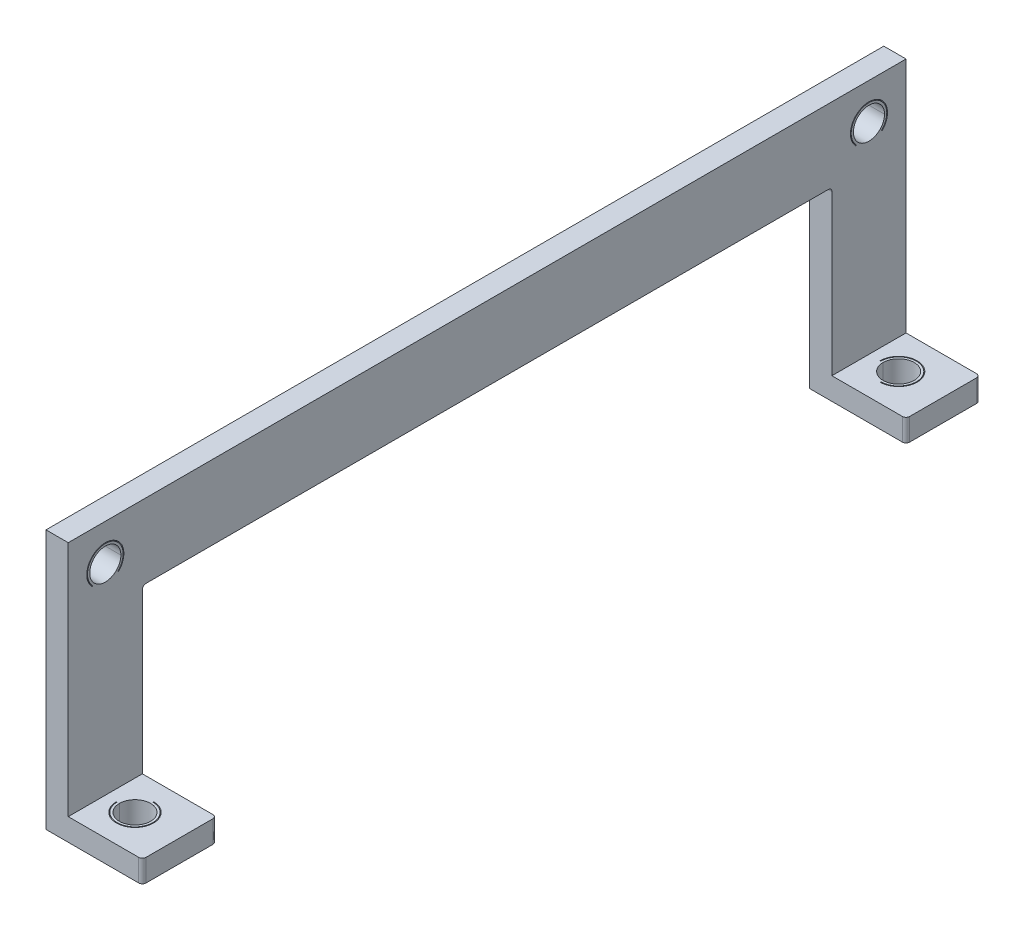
ISO-10303-21;
HEADER;
FILE_DESCRIPTION(('STEP AP214'),'2;1');
FILE_NAME('part.step','',(''),(''),'','','');
FILE_SCHEMA(('AUTOMOTIVE_DESIGN { 1 0 10303 214 1 1 1 1 }'));
ENDSEC;
DATA;
#1=APPLICATION_CONTEXT('core data for automotive mechanical design processes');
#2=APPLICATION_PROTOCOL_DEFINITION('international standard','automotive_design',2000,#1);
#3=PRODUCT_CONTEXT('',#1,'mechanical');
#4=PRODUCT('Part','Part','',(#3));
#5=PRODUCT_RELATED_PRODUCT_CATEGORY('part','',(#4));
#6=PRODUCT_DEFINITION_FORMATION('','',#4);
#7=PRODUCT_DEFINITION_CONTEXT('part definition',#1,'design');
#8=PRODUCT_DEFINITION('design','',#6,#7);
#9=PRODUCT_DEFINITION_SHAPE('','',#8);
#10=(LENGTH_UNIT() NAMED_UNIT(*) SI_UNIT(.MILLI.,.METRE.));
#11=(NAMED_UNIT(*) PLANE_ANGLE_UNIT() SI_UNIT($,.RADIAN.));
#12=(NAMED_UNIT(*) SI_UNIT($,.STERADIAN.) SOLID_ANGLE_UNIT());
#13=UNCERTAINTY_MEASURE_WITH_UNIT(LENGTH_MEASURE(1.E-05),#10,'distance_accuracy_value','');
#14=(GEOMETRIC_REPRESENTATION_CONTEXT(3) GLOBAL_UNCERTAINTY_ASSIGNED_CONTEXT((#13)) GLOBAL_UNIT_ASSIGNED_CONTEXT((#10,
#11,#12)) REPRESENTATION_CONTEXT('',''));
#15=CARTESIAN_POINT('',(0.,0.,0.));
#16=DIRECTION('',(0.,0.,1.));
#17=DIRECTION('',(1.,0.,0.));
#18=AXIS2_PLACEMENT_3D('',#15,#16,#17);
#19=CARTESIAN_POINT('',(-6.57372305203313,28.2322330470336,-53.2677669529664));
#20=DIRECTION('',(0.,0.707106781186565,-0.70710678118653));
#21=DIRECTION('',(-1.,0.,0.));
#22=AXIS2_PLACEMENT_3D('',#19,#20,#21);
#23=PLANE('',#22);
#24=DIRECTION('',(0.,-0.70710678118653,-0.707106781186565));
#25=VECTOR('',#24,1.);
#26=CARTESIAN_POINT('',(3.,69.,-12.4999999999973));
#27=LINE('',#26,#25);
#28=CARTESIAN_POINT('',(3.,28.3029437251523,-53.1970562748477));
#29=VERTEX_POINT('',#28);
#30=CARTESIAN_POINT('',(3.,28.2322330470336,-53.2677669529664));
#31=VERTEX_POINT('',#30);
#32=EDGE_CURVE('E877',#29,#31,#27,.T.);
#33=ORIENTED_EDGE('',*,*,#32,.T.);
#34=DIRECTION('',(1.,0.,0.));
#35=VECTOR('',#34,1.);
#36=CARTESIAN_POINT('',(-6.57372305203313,28.2322330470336,-53.2677669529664));
#37=LINE('',#36,#35);
#38=CARTESIAN_POINT('',(0.,28.2322330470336,-53.2677669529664));
#39=VERTEX_POINT('',#38);
#40=EDGE_CURVE('E9',#39,#31,#37,.T.);
#41=ORIENTED_EDGE('',*,*,#40,.F.);
#42=DIRECTION('',(0.,0.70710678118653,0.707106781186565));
#43=VECTOR('',#42,1.);
#44=CARTESIAN_POINT('',(0.,28.2322330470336,-53.2677669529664));
#45=LINE('',#44,#43);
#46=CARTESIAN_POINT('',(0.,28.3029437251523,-53.1970562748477));
#47=VERTEX_POINT('',#46);
#48=EDGE_CURVE('E725',#39,#47,#45,.T.);
#49=ORIENTED_EDGE('',*,*,#48,.T.);
#50=DIRECTION('',(1.,0.,0.));
#51=VECTOR('',#50,1.);
#52=CARTESIAN_POINT('',(-6.57372305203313,28.3029437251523,-53.1970562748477));
#53=LINE('',#52,#51);
#54=EDGE_CURVE('E679',#47,#29,#53,.T.);
#55=ORIENTED_EDGE('',*,*,#54,.T.);
#56=EDGE_LOOP('',(#33,#41,#49,#55));
#57=FACE_BOUND('',#56,.T.);
#58=ADVANCED_FACE('F15',(#57),#23,.T.);
#59=CARTESIAN_POINT('',(-6.57372305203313,30.,-51.5));
#60=DIRECTION('',(1.,0.,0.));
#61=DIRECTION('',(0.,0.,-1.));
#62=AXIS2_PLACEMENT_3D('',#59,#60,#61);
#63=CYLINDRICAL_SURFACE('',#62,2.5);
#64=DIRECTION('',(1.,0.,0.));
#65=VECTOR('',#64,1.);
#66=CARTESIAN_POINT('',(-6.57372305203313,30.,-54.));
#67=LINE('',#66,#65);
#68=CARTESIAN_POINT('',(0.,30.,-54.));
#69=VERTEX_POINT('',#68);
#70=CARTESIAN_POINT('',(3.,30.,-54.));
#71=VERTEX_POINT('',#70);
#72=EDGE_CURVE('E646',#69,#71,#67,.T.);
#73=ORIENTED_EDGE('',*,*,#72,.F.);
#74=CARTESIAN_POINT('',(0.,30.,-51.5));
#75=DIRECTION('',(-1.,0.,0.));
#76=DIRECTION('',(0.,0.,1.));
#77=AXIS2_PLACEMENT_3D('',#74,#75,#76);
#78=CIRCLE('',#77,2.5);
#79=EDGE_CURVE('E721',#69,#39,#78,.T.);
#80=ORIENTED_EDGE('',*,*,#79,.T.);
#81=ORIENTED_EDGE('',*,*,#40,.T.);
#82=CARTESIAN_POINT('',(3.,30.,-51.5));
#83=DIRECTION('',(1.,0.,0.));
#84=DIRECTION('',(0.,0.,1.));
#85=AXIS2_PLACEMENT_3D('',#82,#83,#84);
#86=CIRCLE('',#85,2.5);
#87=EDGE_CURVE('E463',#31,#71,#86,.T.);
#88=ORIENTED_EDGE('',*,*,#87,.T.);
#89=EDGE_LOOP('',(#73,#80,#81,#88));
#90=FACE_BOUND('',#89,.T.);
#91=ADVANCED_FACE('F1019',(#90),#63,.F.);
#92=CARTESIAN_POINT('',(-6.57372305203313,28.3029437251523,-49.8029437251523));
#93=DIRECTION('',(0.,0.707106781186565,0.70710678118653));
#94=DIRECTION('',(1.,0.,0.));
#95=AXIS2_PLACEMENT_3D('',#92,#93,#94);
#96=PLANE('',#95);
#97=DIRECTION('',(0.,0.70710678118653,-0.707106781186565));
#98=VECTOR('',#97,1.);
#99=CARTESIAN_POINT('',(3.,-38.9999999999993,17.5000000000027));
#100=LINE('',#99,#98);
#101=CARTESIAN_POINT('',(3.,28.2322330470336,-49.7322330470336));
#102=VERTEX_POINT('',#101);
#103=CARTESIAN_POINT('',(3.,28.3029437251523,-49.8029437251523));
#104=VERTEX_POINT('',#103);
#105=EDGE_CURVE('E467',#102,#104,#100,.T.);
#106=ORIENTED_EDGE('',*,*,#105,.T.);
#107=DIRECTION('',(1.,0.,0.));
#108=VECTOR('',#107,1.);
#109=CARTESIAN_POINT('',(-6.57372305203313,28.3029437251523,-49.8029437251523));
#110=LINE('',#109,#108);
#111=CARTESIAN_POINT('',(0.,28.3029437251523,-49.8029437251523));
#112=VERTEX_POINT('',#111);
#113=EDGE_CURVE('E24',#112,#104,#110,.T.);
#114=ORIENTED_EDGE('',*,*,#113,.F.);
#115=DIRECTION('',(0.,-0.70710678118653,0.707106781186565));
#116=VECTOR('',#115,1.);
#117=CARTESIAN_POINT('',(0.,28.3029437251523,-49.8029437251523));
#118=LINE('',#117,#116);
#119=CARTESIAN_POINT('',(0.,28.2322330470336,-49.7322330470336));
#120=VERTEX_POINT('',#119);
#121=EDGE_CURVE('E515',#112,#120,#118,.T.);
#122=ORIENTED_EDGE('',*,*,#121,.T.);
#123=DIRECTION('',(1.,0.,0.));
#124=VECTOR('',#123,1.);
#125=CARTESIAN_POINT('',(-6.57372305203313,28.2322330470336,-49.7322330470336));
#126=LINE('',#125,#124);
#127=EDGE_CURVE('E948',#120,#102,#126,.T.);
#128=ORIENTED_EDGE('',*,*,#127,.T.);
#129=EDGE_LOOP('',(#106,#114,#122,#128));
#130=FACE_BOUND('',#129,.T.);
#131=ADVANCED_FACE('F1023',(#130),#96,.T.);
#132=CARTESIAN_POINT('',(-6.57372305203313,30.,-51.5));
#133=DIRECTION('',(1.,0.,0.));
#134=DIRECTION('',(0.,0.,-1.));
#135=AXIS2_PLACEMENT_3D('',#132,#133,#134);
#136=CYLINDRICAL_SURFACE('',#135,2.4);
#137=DIRECTION('',(1.,0.,0.));
#138=VECTOR('',#137,1.);
#139=CARTESIAN_POINT('',(-6.57372305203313,30.,-49.1));
#140=LINE('',#139,#138);
#141=CARTESIAN_POINT('',(0.,30.,-49.1));
#142=VERTEX_POINT('',#141);
#143=CARTESIAN_POINT('',(3.,30.,-49.1));
#144=VERTEX_POINT('',#143);
#145=EDGE_CURVE('E650',#142,#144,#140,.T.);
#146=ORIENTED_EDGE('',*,*,#145,.F.);
#147=CARTESIAN_POINT('',(0.,30.,-51.5));
#148=DIRECTION('',(-1.,0.,0.));
#149=DIRECTION('',(0.,0.,1.));
#150=AXIS2_PLACEMENT_3D('',#147,#148,#149);
#151=CIRCLE('',#150,2.4);
#152=EDGE_CURVE('E636',#112,#142,#151,.T.);
#153=ORIENTED_EDGE('',*,*,#152,.F.);
#154=ORIENTED_EDGE('',*,*,#113,.T.);
#155=CARTESIAN_POINT('',(3.,30.,-51.5));
#156=DIRECTION('',(1.,0.,0.));
#157=DIRECTION('',(0.,0.,1.));
#158=AXIS2_PLACEMENT_3D('',#155,#156,#157);
#159=CIRCLE('',#158,2.4);
#160=EDGE_CURVE('E710',#144,#104,#159,.T.);
#161=ORIENTED_EDGE('',*,*,#160,.F.);
#162=EDGE_LOOP('',(#146,#153,#154,#161));
#163=FACE_BOUND('',#162,.T.);
#164=ADVANCED_FACE('F1387',(#163),#136,.T.);
#165=CARTESIAN_POINT('',(-6.57372305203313,28.3029437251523,53.1970562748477));
#166=DIRECTION('',(0.,0.70710678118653,0.707106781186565));
#167=DIRECTION('',(1.,0.,0.));
#168=AXIS2_PLACEMENT_3D('',#165,#166,#167);
#169=PLANE('',#168);
#170=DIRECTION('',(0.,-0.707106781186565,0.70710678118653));
#171=VECTOR('',#170,1.);
#172=CARTESIAN_POINT('',(0.,28.3029437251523,53.1970562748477));
#173=LINE('',#172,#171);
#174=CARTESIAN_POINT('',(0.,28.3029437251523,53.1970562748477));
#175=VERTEX_POINT('',#174);
#176=CARTESIAN_POINT('',(0.,28.2322330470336,53.2677669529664));
#177=VERTEX_POINT('',#176);
#178=EDGE_CURVE('E514',#175,#177,#173,.T.);
#179=ORIENTED_EDGE('',*,*,#178,.T.);
#180=DIRECTION('',(1.,0.,0.));
#181=VECTOR('',#180,1.);
#182=CARTESIAN_POINT('',(-6.57372305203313,28.2322330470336,53.2677669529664));
#183=LINE('',#182,#181);
#184=CARTESIAN_POINT('',(3.,28.2322330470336,53.2677669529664));
#185=VERTEX_POINT('',#184);
#186=EDGE_CURVE('E743',#177,#185,#183,.T.);
#187=ORIENTED_EDGE('',*,*,#186,.T.);
#188=DIRECTION('',(0.,-0.707106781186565,0.70710678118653));
#189=VECTOR('',#188,1.);
#190=CARTESIAN_POINT('',(3.,28.3029437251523,53.1970562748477));
#191=LINE('',#190,#189);
#192=CARTESIAN_POINT('',(3.,28.3029437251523,53.1970562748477));
#193=VERTEX_POINT('',#192);
#194=EDGE_CURVE('E466',#193,#185,#191,.T.);
#195=ORIENTED_EDGE('',*,*,#194,.F.);
#196=DIRECTION('',(1.,0.,0.));
#197=VECTOR('',#196,1.);
#198=CARTESIAN_POINT('',(-6.57372305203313,28.3029437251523,53.1970562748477));
#199=LINE('',#198,#197);
#200=EDGE_CURVE('E623',#175,#193,#199,.T.);
#201=ORIENTED_EDGE('',*,*,#200,.F.);
#202=EDGE_LOOP('',(#179,#187,#195,#201));
#203=FACE_BOUND('',#202,.T.);
#204=ADVANCED_FACE('F1390',(#203),#169,.T.);
#205=CARTESIAN_POINT('',(-6.57372305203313,30.,51.5));
#206=DIRECTION('',(1.,0.,0.));
#207=DIRECTION('',(0.,0.,-1.));
#208=AXIS2_PLACEMENT_3D('',#205,#206,#207);
#209=CYLINDRICAL_SURFACE('',#208,2.4);
#210=DIRECTION('',(1.,0.,0.));
#211=VECTOR('',#210,1.);
#212=CARTESIAN_POINT('',(-6.57372305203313,30.,53.9));
#213=LINE('',#212,#211);
#214=CARTESIAN_POINT('',(0.,30.,53.9));
#215=VERTEX_POINT('',#214);
#216=CARTESIAN_POINT('',(3.,30.,53.9));
#217=VERTEX_POINT('',#216);
#218=EDGE_CURVE('E678',#215,#217,#213,.T.);
#219=ORIENTED_EDGE('',*,*,#218,.F.);
#220=CARTESIAN_POINT('',(0.,30.,51.5));
#221=DIRECTION('',(1.,0.,0.));
#222=DIRECTION('',(0.,0.,1.));
#223=AXIS2_PLACEMENT_3D('',#220,#221,#222);
#224=CIRCLE('',#223,2.4);
#225=EDGE_CURVE('E661',#215,#175,#224,.T.);
#226=ORIENTED_EDGE('',*,*,#225,.T.);
#227=ORIENTED_EDGE('',*,*,#200,.T.);
#228=CARTESIAN_POINT('',(3.,30.,51.5));
#229=DIRECTION('',(1.,0.,0.));
#230=DIRECTION('',(0.,0.,-1.));
#231=AXIS2_PLACEMENT_3D('',#228,#229,#230);
#232=CIRCLE('',#231,2.4);
#233=EDGE_CURVE('E486',#217,#193,#232,.T.);
#234=ORIENTED_EDGE('',*,*,#233,.F.);
#235=EDGE_LOOP('',(#219,#226,#227,#234));
#236=FACE_BOUND('',#235,.T.);
#237=ADVANCED_FACE('F1516',(#236),#209,.T.);
#238=CARTESIAN_POINT('',(-6.57372305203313,28.2322330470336,49.7322330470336));
#239=DIRECTION('',(0.,0.707106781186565,-0.70710678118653));
#240=DIRECTION('',(-1.,0.,0.));
#241=AXIS2_PLACEMENT_3D('',#238,#239,#240);
#242=PLANE('',#241);
#243=DIRECTION('',(0.,0.70710678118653,0.707106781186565));
#244=VECTOR('',#243,1.);
#245=CARTESIAN_POINT('',(0.,28.2322330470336,49.7322330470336));
#246=LINE('',#245,#244);
#247=CARTESIAN_POINT('',(0.,28.2322330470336,49.7322330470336));
#248=VERTEX_POINT('',#247);
#249=CARTESIAN_POINT('',(0.,28.3029437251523,49.8029437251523));
#250=VERTEX_POINT('',#249);
#251=EDGE_CURVE('E524',#248,#250,#246,.T.);
#252=ORIENTED_EDGE('',*,*,#251,.T.);
#253=DIRECTION('',(1.,0.,0.));
#254=VECTOR('',#253,1.);
#255=CARTESIAN_POINT('',(-6.57372305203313,28.3029437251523,49.8029437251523));
#256=LINE('',#255,#254);
#257=CARTESIAN_POINT('',(3.,28.3029437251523,49.8029437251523));
#258=VERTEX_POINT('',#257);
#259=EDGE_CURVE('E703',#250,#258,#256,.T.);
#260=ORIENTED_EDGE('',*,*,#259,.T.);
#261=DIRECTION('',(0.,0.70710678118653,0.707106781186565));
#262=VECTOR('',#261,1.);
#263=CARTESIAN_POINT('',(3.,28.2322330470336,49.7322330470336));
#264=LINE('',#263,#262);
#265=CARTESIAN_POINT('',(3.,28.2322330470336,49.7322330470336));
#266=VERTEX_POINT('',#265);
#267=EDGE_CURVE('E479',#266,#258,#264,.T.);
#268=ORIENTED_EDGE('',*,*,#267,.F.);
#269=DIRECTION('',(1.,0.,0.));
#270=VECTOR('',#269,1.);
#271=CARTESIAN_POINT('',(-6.57372305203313,28.2322330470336,49.7322330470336));
#272=LINE('',#271,#270);
#273=EDGE_CURVE('E621',#248,#266,#272,.T.);
#274=ORIENTED_EDGE('',*,*,#273,.F.);
#275=EDGE_LOOP('',(#252,#260,#268,#274));
#276=FACE_BOUND('',#275,.T.);
#277=ADVANCED_FACE('F1507',(#276),#242,.T.);
#278=CARTESIAN_POINT('',(-6.57372305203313,30.,51.5));
#279=DIRECTION('',(1.,0.,0.));
#280=DIRECTION('',(0.,0.,-1.));
#281=AXIS2_PLACEMENT_3D('',#278,#279,#280);
#282=CYLINDRICAL_SURFACE('',#281,2.5);
#283=DIRECTION('',(1.,0.,0.));
#284=VECTOR('',#283,1.);
#285=CARTESIAN_POINT('',(-6.57372305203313,30.,49.));
#286=LINE('',#285,#284);
#287=CARTESIAN_POINT('',(0.,30.,49.));
#288=VERTEX_POINT('',#287);
#289=CARTESIAN_POINT('',(3.,30.,49.));
#290=VERTEX_POINT('',#289);
#291=EDGE_CURVE('E757',#288,#290,#286,.T.);
#292=ORIENTED_EDGE('',*,*,#291,.F.);
#293=CARTESIAN_POINT('',(0.,30.,51.5));
#294=DIRECTION('',(1.,0.,0.));
#295=DIRECTION('',(0.,0.,1.));
#296=AXIS2_PLACEMENT_3D('',#293,#294,#295);
#297=CIRCLE('',#296,2.5);
#298=EDGE_CURVE('E511',#248,#288,#297,.T.);
#299=ORIENTED_EDGE('',*,*,#298,.F.);
#300=ORIENTED_EDGE('',*,*,#273,.T.);
#301=CARTESIAN_POINT('',(3.,30.,51.5));
#302=DIRECTION('',(1.,0.,0.));
#303=DIRECTION('',(0.,0.,-1.));
#304=AXIS2_PLACEMENT_3D('',#301,#302,#303);
#305=CIRCLE('',#304,2.5);
#306=EDGE_CURVE('E470',#266,#290,#305,.T.);
#307=ORIENTED_EDGE('',*,*,#306,.T.);
#308=EDGE_LOOP('',(#292,#299,#300,#307));
#309=FACE_BOUND('',#308,.T.);
#310=ADVANCED_FACE('F1498',(#309),#282,.F.);
#311=CARTESIAN_POINT('',(-5.93969696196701,30.,-51.5));
#312=DIRECTION('',(1.,0.,0.));
#313=DIRECTION('',(0.,0.,-1.));
#314=AXIS2_PLACEMENT_3D('',#311,#312,#313);
#315=CYLINDRICAL_SURFACE('',#314,2.1);
#316=DIRECTION('',(1.,0.,0.));
#317=VECTOR('',#316,1.);
#318=CARTESIAN_POINT('',(-5.93969696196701,30.,-49.4));
#319=LINE('',#318,#317);
#320=CARTESIAN_POINT('',(0.,30.,-49.4));
#321=VERTEX_POINT('',#320);
#322=CARTESIAN_POINT('',(3.,30.,-49.4));
#323=VERTEX_POINT('',#322);
#324=EDGE_CURVE('E777',#321,#323,#319,.T.);
#325=ORIENTED_EDGE('',*,*,#324,.F.);
#326=CARTESIAN_POINT('',(0.,30.,-51.5));
#327=DIRECTION('',(1.,0.,0.));
#328=DIRECTION('',(0.,0.,1.));
#329=AXIS2_PLACEMENT_3D('',#326,#327,#328);
#330=CIRCLE('',#329,2.1);
#331=CARTESIAN_POINT('',(0.,30.,-53.6));
#332=VERTEX_POINT('',#331);
#333=EDGE_CURVE('E520',#332,#321,#330,.T.);
#334=ORIENTED_EDGE('',*,*,#333,.F.);
#335=DIRECTION('',(1.,0.,0.));
#336=VECTOR('',#335,1.);
#337=CARTESIAN_POINT('',(-5.93969696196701,30.,-53.6));
#338=LINE('',#337,#336);
#339=CARTESIAN_POINT('',(3.,30.,-53.6));
#340=VERTEX_POINT('',#339);
#341=EDGE_CURVE('E792',#332,#340,#338,.T.);
#342=ORIENTED_EDGE('',*,*,#341,.T.);
#343=CARTESIAN_POINT('',(3.,30.,-51.5));
#344=DIRECTION('',(1.,0.,0.));
#345=DIRECTION('',(0.,0.,1.));
#346=AXIS2_PLACEMENT_3D('',#343,#344,#345);
#347=CIRCLE('',#346,2.1);
#348=EDGE_CURVE('E490',#340,#323,#347,.T.);
#349=ORIENTED_EDGE('',*,*,#348,.T.);
#350=EDGE_LOOP('',(#325,#334,#342,#349));
#351=FACE_BOUND('',#350,.T.);
#352=ADVANCED_FACE('F1400',(#351),#315,.F.);
#353=CARTESIAN_POINT('',(-5.93969696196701,30.,51.5));
#354=DIRECTION('',(1.,0.,0.));
#355=DIRECTION('',(0.,0.,-1.));
#356=AXIS2_PLACEMENT_3D('',#353,#354,#355);
#357=CYLINDRICAL_SURFACE('',#356,2.1);
#358=DIRECTION('',(1.,0.,0.));
#359=VECTOR('',#358,1.);
#360=CARTESIAN_POINT('',(-5.93969696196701,30.,53.6));
#361=LINE('',#360,#359);
#362=CARTESIAN_POINT('',(0.,30.,53.6));
#363=VERTEX_POINT('',#362);
#364=CARTESIAN_POINT('',(3.,30.,53.6));
#365=VERTEX_POINT('',#364);
#366=EDGE_CURVE('E791',#363,#365,#361,.T.);
#367=ORIENTED_EDGE('',*,*,#366,.F.);
#368=CARTESIAN_POINT('',(0.,30.,51.5));
#369=DIRECTION('',(1.,0.,0.));
#370=DIRECTION('',(0.,0.,1.));
#371=AXIS2_PLACEMENT_3D('',#368,#369,#370);
#372=CIRCLE('',#371,2.1);
#373=CARTESIAN_POINT('',(0.,30.,49.4));
#374=VERTEX_POINT('',#373);
#375=EDGE_CURVE('E523',#374,#363,#372,.T.);
#376=ORIENTED_EDGE('',*,*,#375,.F.);
#377=DIRECTION('',(1.,0.,0.));
#378=VECTOR('',#377,1.);
#379=CARTESIAN_POINT('',(-5.93969696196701,30.,49.4));
#380=LINE('',#379,#378);
#381=CARTESIAN_POINT('',(3.,30.,49.4));
#382=VERTEX_POINT('',#381);
#383=EDGE_CURVE('E806',#374,#382,#380,.T.);
#384=ORIENTED_EDGE('',*,*,#383,.T.);
#385=CARTESIAN_POINT('',(3.,30.,51.5));
#386=DIRECTION('',(1.,0.,0.));
#387=DIRECTION('',(0.,0.,-1.));
#388=AXIS2_PLACEMENT_3D('',#385,#386,#387);
#389=CIRCLE('',#388,2.1);
#390=EDGE_CURVE('E752',#382,#365,#389,.T.);
#391=ORIENTED_EDGE('',*,*,#390,.T.);
#392=EDGE_LOOP('',(#367,#376,#384,#391));
#393=FACE_BOUND('',#392,.T.);
#394=ADVANCED_FACE('F1065',(#393),#357,.F.);
#395=CARTESIAN_POINT('',(7.,-7.07106781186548,-49.));
#396=DIRECTION('',(1.,0.,0.));
#397=DIRECTION('',(0.,0.,-1.));
#398=AXIS2_PLACEMENT_3D('',#395,#396,#397);
#399=PLANE('',#398);
#400=DIRECTION('',(0.,0.,-1.));
#401=VECTOR('',#400,1.);
#402=CARTESIAN_POINT('',(7.,0.,-49.));
#403=LINE('',#402,#401);
#404=CARTESIAN_POINT('',(7.,0.,-49.));
#405=VERTEX_POINT('',#404);
#406=CARTESIAN_POINT('',(7.,0.,-49.1));
#407=VERTEX_POINT('',#406);
#408=EDGE_CURVE('E471',#405,#407,#403,.T.);
#409=ORIENTED_EDGE('',*,*,#408,.T.);
#410=DIRECTION('',(0.,1.,0.));
#411=VECTOR('',#410,1.);
#412=CARTESIAN_POINT('',(7.,-7.07106781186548,-49.1));
#413=LINE('',#412,#411);
#414=CARTESIAN_POINT('',(7.,3.,-49.1));
#415=VERTEX_POINT('',#414);
#416=EDGE_CURVE('E613',#407,#415,#413,.T.);
#417=ORIENTED_EDGE('',*,*,#416,.T.);
#418=DIRECTION('',(0.,0.,-1.));
#419=VECTOR('',#418,1.);
#420=CARTESIAN_POINT('',(7.,3.,-49.));
#421=LINE('',#420,#419);
#422=CARTESIAN_POINT('',(7.,3.,-49.));
#423=VERTEX_POINT('',#422);
#424=EDGE_CURVE('E519',#423,#415,#421,.T.);
#425=ORIENTED_EDGE('',*,*,#424,.F.);
#426=DIRECTION('',(0.,1.,0.));
#427=VECTOR('',#426,1.);
#428=CARTESIAN_POINT('',(7.,-7.07106781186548,-49.));
#429=LINE('',#428,#427);
#430=EDGE_CURVE('E618',#405,#423,#429,.T.);
#431=ORIENTED_EDGE('',*,*,#430,.F.);
#432=EDGE_LOOP('',(#409,#417,#425,#431));
#433=FACE_BOUND('',#432,.T.);
#434=ADVANCED_FACE('F1108',(#433),#399,.T.);
#435=CARTESIAN_POINT('',(7.,-7.07106781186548,-51.5));
#436=DIRECTION('',(0.,1.,0.));
#437=DIRECTION('',(-1.,0.,0.));
#438=AXIS2_PLACEMENT_3D('',#435,#436,#437);
#439=CYLINDRICAL_SURFACE('',#438,2.5);
#440=CARTESIAN_POINT('',(7.,0.,-51.5));
#441=DIRECTION('',(0.,-1.,0.));
#442=DIRECTION('',(1.,0.,0.));
#443=AXIS2_PLACEMENT_3D('',#440,#441,#442);
#444=CIRCLE('',#443,2.5);
#445=CARTESIAN_POINT('',(4.5,0.,-51.5));
#446=VERTEX_POINT('',#445);
#447=EDGE_CURVE('E475',#446,#405,#444,.T.);
#448=ORIENTED_EDGE('',*,*,#447,.T.);
#449=ORIENTED_EDGE('',*,*,#430,.T.);
#450=CARTESIAN_POINT('',(7.,3.,-51.5));
#451=DIRECTION('',(0.,-1.,0.));
#452=DIRECTION('',(1.,0.,0.));
#453=AXIS2_PLACEMENT_3D('',#450,#451,#452);
#454=CIRCLE('',#453,2.5);
#455=CARTESIAN_POINT('',(4.5,3.,-51.5));
#456=VERTEX_POINT('',#455);
#457=EDGE_CURVE('E575',#456,#423,#454,.T.);
#458=ORIENTED_EDGE('',*,*,#457,.F.);
#459=DIRECTION('',(0.,1.,0.));
#460=VECTOR('',#459,1.);
#461=CARTESIAN_POINT('',(4.5,-7.07106781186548,-51.5));
#462=LINE('',#461,#460);
#463=EDGE_CURVE('E36',#446,#456,#462,.T.);
#464=ORIENTED_EDGE('',*,*,#463,.F.);
#465=EDGE_LOOP('',(#448,#449,#458,#464));
#466=FACE_BOUND('',#465,.T.);
#467=ADVANCED_FACE('F1105',(#466),#439,.F.);
#468=CARTESIAN_POINT('',(4.6,-7.07106781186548,-51.5));
#469=DIRECTION('',(0.,0.,-1.));
#470=DIRECTION('',(0.,-1.,0.));
#471=AXIS2_PLACEMENT_3D('',#468,#469,#470);
#472=PLANE('',#471);
#473=DIRECTION('',(-1.,0.,0.));
#474=VECTOR('',#473,1.);
#475=CARTESIAN_POINT('',(4.6,0.,-51.5));
#476=LINE('',#475,#474);
#477=CARTESIAN_POINT('',(4.6,0.,-51.5));
#478=VERTEX_POINT('',#477);
#479=EDGE_CURVE('E483',#478,#446,#476,.T.);
#480=ORIENTED_EDGE('',*,*,#479,.T.);
#481=ORIENTED_EDGE('',*,*,#463,.T.);
#482=DIRECTION('',(-1.,0.,0.));
#483=VECTOR('',#482,1.);
#484=CARTESIAN_POINT('',(4.6,3.,-51.5));
#485=LINE('',#484,#483);
#486=CARTESIAN_POINT('',(4.6,3.,-51.5));
#487=VERTEX_POINT('',#486);
#488=EDGE_CURVE('E571',#487,#456,#485,.T.);
#489=ORIENTED_EDGE('',*,*,#488,.F.);
#490=DIRECTION('',(0.,1.,0.));
#491=VECTOR('',#490,1.);
#492=CARTESIAN_POINT('',(4.6,-7.07106781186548,-51.5));
#493=LINE('',#492,#491);
#494=EDGE_CURVE('E610',#478,#487,#493,.T.);
#495=ORIENTED_EDGE('',*,*,#494,.F.);
#496=EDGE_LOOP('',(#480,#481,#489,#495));
#497=FACE_BOUND('',#496,.T.);
#498=ADVANCED_FACE('F1089',(#497),#472,.T.);
#499=CARTESIAN_POINT('',(7.,-7.07106781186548,-51.5));
#500=DIRECTION('',(0.,1.,0.));
#501=DIRECTION('',(-1.,0.,0.));
#502=AXIS2_PLACEMENT_3D('',#499,#500,#501);
#503=CYLINDRICAL_SURFACE('',#502,2.4);
#504=ORIENTED_EDGE('',*,*,#494,.T.);
#505=CARTESIAN_POINT('',(7.,3.,-51.5));
#506=DIRECTION('',(0.,-1.,0.));
#507=DIRECTION('',(1.,0.,0.));
#508=AXIS2_PLACEMENT_3D('',#505,#506,#507);
#509=CIRCLE('',#508,2.4);
#510=EDGE_CURVE('E567',#487,#415,#509,.T.);
#511=ORIENTED_EDGE('',*,*,#510,.T.);
#512=ORIENTED_EDGE('',*,*,#416,.F.);
#513=CARTESIAN_POINT('',(7.,0.,-51.5));
#514=DIRECTION('',(0.,-1.,0.));
#515=DIRECTION('',(1.,0.,0.));
#516=AXIS2_PLACEMENT_3D('',#513,#514,#515);
#517=CIRCLE('',#516,2.4);
#518=EDGE_CURVE('E476',#478,#407,#517,.T.);
#519=ORIENTED_EDGE('',*,*,#518,.F.);
#520=EDGE_LOOP('',(#504,#511,#512,#519));
#521=FACE_BOUND('',#520,.T.);
#522=ADVANCED_FACE('F1016',(#521),#503,.T.);
#523=CARTESIAN_POINT('',(7.,-7.07106781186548,49.1));
#524=DIRECTION('',(1.,0.,0.));
#525=DIRECTION('',(0.,-1.,0.));
#526=AXIS2_PLACEMENT_3D('',#523,#524,#525);
#527=PLANE('',#526);
#528=DIRECTION('',(0.,0.,-1.));
#529=VECTOR('',#528,1.);
#530=CARTESIAN_POINT('',(7.,0.,49.1));
#531=LINE('',#530,#529);
#532=CARTESIAN_POINT('',(7.,0.,49.1));
#533=VERTEX_POINT('',#532);
#534=CARTESIAN_POINT('',(7.,0.,49.));
#535=VERTEX_POINT('',#534);
#536=EDGE_CURVE('E715',#533,#535,#531,.T.);
#537=ORIENTED_EDGE('',*,*,#536,.T.);
#538=DIRECTION('',(0.,1.,0.));
#539=VECTOR('',#538,1.);
#540=CARTESIAN_POINT('',(7.,-7.07106781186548,49.));
#541=LINE('',#540,#539);
#542=CARTESIAN_POINT('',(7.,3.,49.));
#543=VERTEX_POINT('',#542);
#544=EDGE_CURVE('E603',#535,#543,#541,.T.);
#545=ORIENTED_EDGE('',*,*,#544,.T.);
#546=DIRECTION('',(0.,0.,-1.));
#547=VECTOR('',#546,1.);
#548=CARTESIAN_POINT('',(7.,3.,49.1));
#549=LINE('',#548,#547);
#550=CARTESIAN_POINT('',(7.,3.,49.1));
#551=VERTEX_POINT('',#550);
#552=EDGE_CURVE('E913',#551,#543,#549,.T.);
#553=ORIENTED_EDGE('',*,*,#552,.F.);
#554=DIRECTION('',(0.,1.,0.));
#555=VECTOR('',#554,1.);
#556=CARTESIAN_POINT('',(7.,-7.07106781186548,49.1));
#557=LINE('',#556,#555);
#558=EDGE_CURVE('E607',#533,#551,#557,.T.);
#559=ORIENTED_EDGE('',*,*,#558,.F.);
#560=EDGE_LOOP('',(#537,#545,#553,#559));
#561=FACE_BOUND('',#560,.T.);
#562=ADVANCED_FACE('F997',(#561),#527,.T.);
#563=CARTESIAN_POINT('',(7.,-7.07106781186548,51.5));
#564=DIRECTION('',(0.,1.,0.));
#565=DIRECTION('',(-1.,0.,0.));
#566=AXIS2_PLACEMENT_3D('',#563,#564,#565);
#567=CYLINDRICAL_SURFACE('',#566,2.4);
#568=CARTESIAN_POINT('',(7.,0.,51.5));
#569=DIRECTION('',(0.,1.,0.));
#570=DIRECTION('',(1.,0.,0.));
#571=AXIS2_PLACEMENT_3D('',#568,#569,#570);
#572=CIRCLE('',#571,2.4);
#573=CARTESIAN_POINT('',(4.6,0.,51.5));
#574=VERTEX_POINT('',#573);
#575=EDGE_CURVE('E729',#574,#533,#572,.T.);
#576=ORIENTED_EDGE('',*,*,#575,.T.);
#577=ORIENTED_EDGE('',*,*,#558,.T.);
#578=CARTESIAN_POINT('',(7.,3.,51.5));
#579=DIRECTION('',(0.,1.,0.));
#580=DIRECTION('',(1.,0.,0.));
#581=AXIS2_PLACEMENT_3D('',#578,#579,#580);
#582=CIRCLE('',#581,2.4);
#583=CARTESIAN_POINT('',(4.6,3.,51.5));
#584=VERTEX_POINT('',#583);
#585=EDGE_CURVE('E638',#584,#551,#582,.T.);
#586=ORIENTED_EDGE('',*,*,#585,.F.);
#587=DIRECTION('',(0.,1.,0.));
#588=VECTOR('',#587,1.);
#589=CARTESIAN_POINT('',(4.6,-7.07106781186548,51.5));
#590=LINE('',#589,#588);
#591=EDGE_CURVE('E604',#574,#584,#590,.T.);
#592=ORIENTED_EDGE('',*,*,#591,.F.);
#593=EDGE_LOOP('',(#576,#577,#586,#592));
#594=FACE_BOUND('',#593,.T.);
#595=ADVANCED_FACE('F1007',(#594),#567,.T.);
#596=CARTESIAN_POINT('',(4.5,-7.07106781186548,51.5));
#597=DIRECTION('',(0.,0.,1.));
#598=DIRECTION('',(1.,0.,0.));
#599=AXIS2_PLACEMENT_3D('',#596,#597,#598);
#600=PLANE('',#599);
#601=DIRECTION('',(1.,0.,0.));
#602=VECTOR('',#601,1.);
#603=CARTESIAN_POINT('',(4.5,0.,51.5));
#604=LINE('',#603,#602);
#605=CARTESIAN_POINT('',(4.5,0.,51.5));
#606=VERTEX_POINT('',#605);
#607=EDGE_CURVE('E739',#606,#574,#604,.T.);
#608=ORIENTED_EDGE('',*,*,#607,.T.);
#609=ORIENTED_EDGE('',*,*,#591,.T.);
#610=DIRECTION('',(1.,0.,0.));
#611=VECTOR('',#610,1.);
#612=CARTESIAN_POINT('',(4.5,3.,51.5));
#613=LINE('',#612,#611);
#614=CARTESIAN_POINT('',(4.5,3.,51.5));
#615=VERTEX_POINT('',#614);
#616=EDGE_CURVE('E641',#615,#584,#613,.T.);
#617=ORIENTED_EDGE('',*,*,#616,.F.);
#618=DIRECTION('',(0.,1.,0.));
#619=VECTOR('',#618,1.);
#620=CARTESIAN_POINT('',(4.5,-7.07106781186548,51.5));
#621=LINE('',#620,#619);
#622=EDGE_CURVE('E435',#606,#615,#621,.T.);
#623=ORIENTED_EDGE('',*,*,#622,.F.);
#624=EDGE_LOOP('',(#608,#609,#617,#623));
#625=FACE_BOUND('',#624,.T.);
#626=ADVANCED_FACE('F1005',(#625),#600,.T.);
#627=CARTESIAN_POINT('',(7.,-7.07106781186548,51.5));
#628=DIRECTION('',(0.,1.,0.));
#629=DIRECTION('',(-1.,0.,0.));
#630=AXIS2_PLACEMENT_3D('',#627,#628,#629);
#631=CYLINDRICAL_SURFACE('',#630,2.5);
#632=ORIENTED_EDGE('',*,*,#622,.T.);
#633=CARTESIAN_POINT('',(7.,3.,51.5));
#634=DIRECTION('',(0.,1.,0.));
#635=DIRECTION('',(-1.,0.,0.));
#636=AXIS2_PLACEMENT_3D('',#633,#634,#635);
#637=CIRCLE('',#636,2.5);
#638=EDGE_CURVE('E916',#615,#543,#637,.T.);
#639=ORIENTED_EDGE('',*,*,#638,.T.);
#640=ORIENTED_EDGE('',*,*,#544,.F.);
#641=CARTESIAN_POINT('',(7.,0.,51.5));
#642=DIRECTION('',(0.,1.,0.));
#643=DIRECTION('',(1.,0.,0.));
#644=AXIS2_PLACEMENT_3D('',#641,#642,#643);
#645=CIRCLE('',#644,2.5);
#646=EDGE_CURVE('E711',#606,#535,#645,.T.);
#647=ORIENTED_EDGE('',*,*,#646,.F.);
#648=EDGE_LOOP('',(#632,#639,#640,#647));
#649=FACE_BOUND('',#648,.T.);
#650=ADVANCED_FACE('F988',(#649),#631,.F.);
#651=CARTESIAN_POINT('',(7.,-5.93969696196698,51.5));
#652=DIRECTION('',(0.,1.,0.));
#653=DIRECTION('',(-1.,0.,0.));
#654=AXIS2_PLACEMENT_3D('',#651,#652,#653);
#655=CYLINDRICAL_SURFACE('',#654,2.1);
#656=DIRECTION('',(0.,1.,0.));
#657=VECTOR('',#656,1.);
#658=CARTESIAN_POINT('',(9.1,-5.93969696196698,51.5));
#659=LINE('',#658,#657);
#660=CARTESIAN_POINT('',(9.1,0.,51.5));
#661=VERTEX_POINT('',#660);
#662=CARTESIAN_POINT('',(9.1,3.,51.5));
#663=VERTEX_POINT('',#662);
#664=EDGE_CURVE('E819',#661,#663,#659,.T.);
#665=ORIENTED_EDGE('',*,*,#664,.F.);
#666=CARTESIAN_POINT('',(7.,0.,51.5));
#667=DIRECTION('',(0.,1.,0.));
#668=DIRECTION('',(1.,0.,0.));
#669=AXIS2_PLACEMENT_3D('',#666,#667,#668);
#670=CIRCLE('',#669,2.1);
#671=CARTESIAN_POINT('',(4.9,0.,51.5));
#672=VERTEX_POINT('',#671);
#673=EDGE_CURVE('E747',#672,#661,#670,.T.);
#674=ORIENTED_EDGE('',*,*,#673,.F.);
#675=DIRECTION('',(0.,1.,0.));
#676=VECTOR('',#675,1.);
#677=CARTESIAN_POINT('',(4.9,-5.93969696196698,51.5));
#678=LINE('',#677,#676);
#679=CARTESIAN_POINT('',(4.9,3.,51.5));
#680=VERTEX_POINT('',#679);
#681=EDGE_CURVE('E827',#672,#680,#678,.T.);
#682=ORIENTED_EDGE('',*,*,#681,.T.);
#683=CARTESIAN_POINT('',(7.,3.,51.5));
#684=DIRECTION('',(0.,1.,0.));
#685=DIRECTION('',(-1.,0.,0.));
#686=AXIS2_PLACEMENT_3D('',#683,#684,#685);
#687=CIRCLE('',#686,2.1);
#688=EDGE_CURVE('E460',#680,#663,#687,.T.);
#689=ORIENTED_EDGE('',*,*,#688,.T.);
#690=EDGE_LOOP('',(#665,#674,#682,#689));
#691=FACE_BOUND('',#690,.T.);
#692=ADVANCED_FACE('F1044',(#691),#655,.F.);
#693=CARTESIAN_POINT('',(7.,-5.93969696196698,-51.5));
#694=DIRECTION('',(0.,1.,0.));
#695=DIRECTION('',(-1.,0.,0.));
#696=AXIS2_PLACEMENT_3D('',#693,#694,#695);
#697=CYLINDRICAL_SURFACE('',#696,2.1);
#698=DIRECTION('',(0.,1.,0.));
#699=VECTOR('',#698,1.);
#700=CARTESIAN_POINT('',(9.1,-5.93969696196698,-51.5));
#701=LINE('',#700,#699);
#702=CARTESIAN_POINT('',(9.1,0.,-51.5));
#703=VERTEX_POINT('',#702);
#704=CARTESIAN_POINT('',(9.1,3.,-51.5));
#705=VERTEX_POINT('',#704);
#706=EDGE_CURVE('E835',#703,#705,#701,.T.);
#707=ORIENTED_EDGE('',*,*,#706,.F.);
#708=CARTESIAN_POINT('',(7.,0.,-51.5));
#709=DIRECTION('',(0.,1.,0.));
#710=DIRECTION('',(1.,0.,0.));
#711=AXIS2_PLACEMENT_3D('',#708,#709,#710);
#712=CIRCLE('',#711,2.1);
#713=CARTESIAN_POINT('',(4.9,0.,-51.5));
#714=VERTEX_POINT('',#713);
#715=EDGE_CURVE('E548',#714,#703,#712,.T.);
#716=ORIENTED_EDGE('',*,*,#715,.F.);
#717=DIRECTION('',(0.,1.,0.));
#718=VECTOR('',#717,1.);
#719=CARTESIAN_POINT('',(4.9,-5.93969696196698,-51.5));
#720=LINE('',#719,#718);
#721=CARTESIAN_POINT('',(4.9,3.,-51.5));
#722=VERTEX_POINT('',#721);
#723=EDGE_CURVE('E848',#714,#722,#720,.T.);
#724=ORIENTED_EDGE('',*,*,#723,.T.);
#725=CARTESIAN_POINT('',(7.,3.,-51.5));
#726=DIRECTION('',(0.,1.,0.));
#727=DIRECTION('',(-1.,0.,0.));
#728=AXIS2_PLACEMENT_3D('',#725,#726,#727);
#729=CIRCLE('',#728,2.1);
#730=EDGE_CURVE('E579',#722,#705,#729,.T.);
#731=ORIENTED_EDGE('',*,*,#730,.T.);
#732=EDGE_LOOP('',(#707,#716,#724,#731));
#733=FACE_BOUND('',#732,.T.);
#734=ADVANCED_FACE('F1116',(#733),#697,.F.);
#735=CARTESIAN_POINT('',(12.5,3.,56.));
#736=DIRECTION('',(0.,1.,0.));
#737=DIRECTION('',(0.,0.,1.));
#738=AXIS2_PLACEMENT_3D('',#735,#736,#737);
#739=CYLINDRICAL_SURFACE('',#738,0.5);
#740=CARTESIAN_POINT('',(12.5,3.,56.));
#741=DIRECTION('',(0.,1.,0.));
#742=DIRECTION('',(1.,0.,0.));
#743=AXIS2_PLACEMENT_3D('',#740,#741,#742);
#744=CIRCLE('',#743,0.5);
#745=CARTESIAN_POINT('',(12.5,3.,56.5));
#746=VERTEX_POINT('',#745);
#747=CARTESIAN_POINT('',(13.,3.,56.));
#748=VERTEX_POINT('',#747);
#749=EDGE_CURVE('E811',#746,#748,#744,.T.);
#750=ORIENTED_EDGE('',*,*,#749,.F.);
#751=DIRECTION('',(0.,1.,0.));
#752=VECTOR('',#751,1.);
#753=CARTESIAN_POINT('',(12.5,3.,56.5));
#754=LINE('',#753,#752);
#755=CARTESIAN_POINT('',(12.5,0.,56.5));
#756=VERTEX_POINT('',#755);
#757=EDGE_CURVE('E582',#756,#746,#754,.T.);
#758=ORIENTED_EDGE('',*,*,#757,.F.);
#759=CARTESIAN_POINT('',(12.5,0.,56.));
#760=DIRECTION('',(0.,-1.,0.));
#761=DIRECTION('',(1.,0.,0.));
#762=AXIS2_PLACEMENT_3D('',#759,#760,#761);
#763=CIRCLE('',#762,0.5);
#764=CARTESIAN_POINT('',(13.,0.,56.));
#765=VERTEX_POINT('',#764);
#766=EDGE_CURVE('E873',#765,#756,#763,.T.);
#767=ORIENTED_EDGE('',*,*,#766,.F.);
#768=DIRECTION('',(0.,-1.,0.));
#769=VECTOR('',#768,1.);
#770=CARTESIAN_POINT('',(13.,0.,56.));
#771=LINE('',#770,#769);
#772=EDGE_CURVE('E770',#748,#765,#771,.T.);
#773=ORIENTED_EDGE('',*,*,#772,.F.);
#774=EDGE_LOOP('',(#750,#758,#767,#773));
#775=FACE_BOUND('',#774,.T.);
#776=ADVANCED_FACE('F1075',(#775),#739,.T.);
#777=CARTESIAN_POINT('',(12.5,3.,47.));
#778=DIRECTION('',(0.,-1.,0.));
#779=DIRECTION('',(0.,0.,-1.));
#780=AXIS2_PLACEMENT_3D('',#777,#778,#779);
#781=CYLINDRICAL_SURFACE('',#780,0.5);
#782=CARTESIAN_POINT('',(12.5,0.,47.));
#783=DIRECTION('',(0.,-1.,0.));
#784=DIRECTION('',(1.,0.,0.));
#785=AXIS2_PLACEMENT_3D('',#782,#783,#784);
#786=CIRCLE('',#785,0.5);
#787=CARTESIAN_POINT('',(12.5,0.,46.5));
#788=VERTEX_POINT('',#787);
#789=CARTESIAN_POINT('',(13.,0.,47.));
#790=VERTEX_POINT('',#789);
#791=EDGE_CURVE('E856',#788,#790,#786,.T.);
#792=ORIENTED_EDGE('',*,*,#791,.F.);
#793=DIRECTION('',(0.,-1.,0.));
#794=VECTOR('',#793,1.);
#795=CARTESIAN_POINT('',(12.5,0.,46.5));
#796=LINE('',#795,#794);
#797=CARTESIAN_POINT('',(12.5,3.,46.5));
#798=VERTEX_POINT('',#797);
#799=EDGE_CURVE('E596',#798,#788,#796,.T.);
#800=ORIENTED_EDGE('',*,*,#799,.F.);
#801=CARTESIAN_POINT('',(12.5,3.,47.));
#802=DIRECTION('',(0.,1.,0.));
#803=DIRECTION('',(1.,0.,0.));
#804=AXIS2_PLACEMENT_3D('',#801,#802,#803);
#805=CIRCLE('',#804,0.5);
#806=CARTESIAN_POINT('',(13.,3.,47.));
#807=VERTEX_POINT('',#806);
#808=EDGE_CURVE('E798',#807,#798,#805,.T.);
#809=ORIENTED_EDGE('',*,*,#808,.F.);
#810=DIRECTION('',(0.,1.,0.));
#811=VECTOR('',#810,1.);
#812=CARTESIAN_POINT('',(13.,3.,47.));
#813=LINE('',#812,#811);
#814=EDGE_CURVE('E758',#790,#807,#813,.T.);
#815=ORIENTED_EDGE('',*,*,#814,.F.);
#816=EDGE_LOOP('',(#792,#800,#809,#815));
#817=FACE_BOUND('',#816,.T.);
#818=ADVANCED_FACE('F1071',(#817),#781,.T.);
#819=CARTESIAN_POINT('',(109.301609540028,24.5,46.));
#820=DIRECTION('',(1.,0.,0.));
#821=DIRECTION('',(0.,0.,-1.));
#822=AXIS2_PLACEMENT_3D('',#819,#820,#821);
#823=CYLINDRICAL_SURFACE('',#822,0.5);
#824=CARTESIAN_POINT('',(3.,24.5,46.));
#825=DIRECTION('',(-1.,0.,0.));
#826=DIRECTION('',(0.,0.,1.));
#827=AXIS2_PLACEMENT_3D('',#824,#825,#826);
#828=CIRCLE('',#827,0.5);
#829=CARTESIAN_POINT('',(3.,24.5,46.5));
#830=VERTEX_POINT('',#829);
#831=CARTESIAN_POINT('',(3.,25.,46.));
#832=VERTEX_POINT('',#831);
#833=EDGE_CURVE('E457',#830,#832,#828,.T.);
#834=ORIENTED_EDGE('',*,*,#833,.F.);
#835=DIRECTION('',(1.,0.,0.));
#836=VECTOR('',#835,1.);
#837=CARTESIAN_POINT('',(3.,24.5,46.5));
#838=LINE('',#837,#836);
#839=CARTESIAN_POINT('',(0.,24.5,46.5));
#840=VERTEX_POINT('',#839);
#841=EDGE_CURVE('E593',#840,#830,#838,.T.);
#842=ORIENTED_EDGE('',*,*,#841,.F.);
#843=CARTESIAN_POINT('',(0.,24.5,46.));
#844=DIRECTION('',(1.,0.,0.));
#845=DIRECTION('',(0.,0.,1.));
#846=AXIS2_PLACEMENT_3D('',#843,#844,#845);
#847=CIRCLE('',#846,0.5);
#848=CARTESIAN_POINT('',(0.,25.,46.));
#849=VERTEX_POINT('',#848);
#850=EDGE_CURVE('E923',#849,#840,#847,.T.);
#851=ORIENTED_EDGE('',*,*,#850,.F.);
#852=DIRECTION('',(-1.,0.,0.));
#853=VECTOR('',#852,1.);
#854=CARTESIAN_POINT('',(0.,25.,46.));
#855=LINE('',#854,#853);
#856=EDGE_CURVE('E590',#832,#849,#855,.T.);
#857=ORIENTED_EDGE('',*,*,#856,.F.);
#858=EDGE_LOOP('',(#834,#842,#851,#857));
#859=FACE_BOUND('',#858,.T.);
#860=ADVANCED_FACE('F1074',(#859),#823,.F.);
#861=CARTESIAN_POINT('',(109.301609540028,24.5,-46.));
#862=DIRECTION('',(1.,0.,0.));
#863=DIRECTION('',(0.,0.,-1.));
#864=AXIS2_PLACEMENT_3D('',#861,#862,#863);
#865=CYLINDRICAL_SURFACE('',#864,0.5);
#866=CARTESIAN_POINT('',(3.,24.5,-46.));
#867=DIRECTION('',(-1.,0.,0.));
#868=DIRECTION('',(0.,0.,1.));
#869=AXIS2_PLACEMENT_3D('',#866,#867,#868);
#870=CIRCLE('',#869,0.5);
#871=CARTESIAN_POINT('',(3.,25.,-46.));
#872=VERTEX_POINT('',#871);
#873=CARTESIAN_POINT('',(3.,24.5,-46.5));
#874=VERTEX_POINT('',#873);
#875=EDGE_CURVE('E428',#872,#874,#870,.T.);
#876=ORIENTED_EDGE('',*,*,#875,.F.);
#877=DIRECTION('',(1.,0.,0.));
#878=VECTOR('',#877,1.);
#879=CARTESIAN_POINT('',(3.,25.,-46.));
#880=LINE('',#879,#878);
#881=CARTESIAN_POINT('',(0.,25.,-46.));
#882=VERTEX_POINT('',#881);
#883=EDGE_CURVE('E587',#882,#872,#880,.T.);
#884=ORIENTED_EDGE('',*,*,#883,.F.);
#885=CARTESIAN_POINT('',(0.,24.5,-46.));
#886=DIRECTION('',(1.,0.,0.));
#887=DIRECTION('',(0.,0.,1.));
#888=AXIS2_PLACEMENT_3D('',#885,#886,#887);
#889=CIRCLE('',#888,0.5);
#890=CARTESIAN_POINT('',(0.,24.5,-46.5));
#891=VERTEX_POINT('',#890);
#892=EDGE_CURVE('E431',#891,#882,#889,.T.);
#893=ORIENTED_EDGE('',*,*,#892,.F.);
#894=DIRECTION('',(-1.,0.,0.));
#895=VECTOR('',#894,1.);
#896=CARTESIAN_POINT('',(0.,24.5,-46.5));
#897=LINE('',#896,#895);
#898=EDGE_CURVE('E424',#874,#891,#897,.T.);
#899=ORIENTED_EDGE('',*,*,#898,.F.);
#900=EDGE_LOOP('',(#876,#884,#893,#899));
#901=FACE_BOUND('',#900,.T.);
#902=ADVANCED_FACE('F426',(#901),#865,.F.);
#903=CARTESIAN_POINT('',(12.5,3.,-47.));
#904=DIRECTION('',(0.,1.,0.));
#905=DIRECTION('',(0.,0.,1.));
#906=AXIS2_PLACEMENT_3D('',#903,#904,#905);
#907=CYLINDRICAL_SURFACE('',#906,0.5);
#908=CARTESIAN_POINT('',(12.5,3.,-47.));
#909=DIRECTION('',(0.,1.,0.));
#910=DIRECTION('',(1.,0.,0.));
#911=AXIS2_PLACEMENT_3D('',#908,#909,#910);
#912=CIRCLE('',#911,0.5);
#913=CARTESIAN_POINT('',(12.5,3.,-46.5));
#914=VERTEX_POINT('',#913);
#915=CARTESIAN_POINT('',(13.,3.,-47.));
#916=VERTEX_POINT('',#915);
#917=EDGE_CURVE('E516',#914,#916,#912,.T.);
#918=ORIENTED_EDGE('',*,*,#917,.F.);
#919=DIRECTION('',(0.,1.,0.));
#920=VECTOR('',#919,1.);
#921=CARTESIAN_POINT('',(12.5,3.,-46.5));
#922=LINE('',#921,#920);
#923=CARTESIAN_POINT('',(12.5,0.,-46.5));
#924=VERTEX_POINT('',#923);
#925=EDGE_CURVE('E411',#924,#914,#922,.T.);
#926=ORIENTED_EDGE('',*,*,#925,.F.);
#927=CARTESIAN_POINT('',(12.5,0.,-47.));
#928=DIRECTION('',(0.,-1.,0.));
#929=DIRECTION('',(1.,0.,0.));
#930=AXIS2_PLACEMENT_3D('',#927,#928,#929);
#931=CIRCLE('',#930,0.5);
#932=CARTESIAN_POINT('',(13.,0.,-47.));
#933=VERTEX_POINT('',#932);
#934=EDGE_CURVE('E536',#933,#924,#931,.T.);
#935=ORIENTED_EDGE('',*,*,#934,.F.);
#936=DIRECTION('',(0.,-1.,0.));
#937=VECTOR('',#936,1.);
#938=CARTESIAN_POINT('',(13.,0.,-47.));
#939=LINE('',#938,#937);
#940=EDGE_CURVE('E557',#916,#933,#939,.T.);
#941=ORIENTED_EDGE('',*,*,#940,.F.);
#942=EDGE_LOOP('',(#918,#926,#935,#941));
#943=FACE_BOUND('',#942,.T.);
#944=ADVANCED_FACE('F1140',(#943),#907,.T.);
#945=CARTESIAN_POINT('',(12.5,35.,-56.));
#946=DIRECTION('',(0.,-1.,0.));
#947=DIRECTION('',(0.,0.,-1.));
#948=AXIS2_PLACEMENT_3D('',#945,#946,#947);
#949=CYLINDRICAL_SURFACE('',#948,0.5);
#950=CARTESIAN_POINT('',(12.5,3.,-56.));
#951=DIRECTION('',(0.,1.,0.));
#952=DIRECTION('',(1.,0.,0.));
#953=AXIS2_PLACEMENT_3D('',#950,#951,#952);
#954=CIRCLE('',#953,0.5);
#955=CARTESIAN_POINT('',(13.,3.,-56.));
#956=VERTEX_POINT('',#955);
#957=CARTESIAN_POINT('',(12.5,3.,-56.5));
#958=VERTEX_POINT('',#957);
#959=EDGE_CURVE('E561',#956,#958,#954,.T.);
#960=ORIENTED_EDGE('',*,*,#959,.F.);
#961=DIRECTION('',(0.,1.,0.));
#962=VECTOR('',#961,1.);
#963=CARTESIAN_POINT('',(13.,3.,-56.));
#964=LINE('',#963,#962);
#965=CARTESIAN_POINT('',(13.,0.,-56.));
#966=VERTEX_POINT('',#965);
#967=EDGE_CURVE('E549',#966,#956,#964,.T.);
#968=ORIENTED_EDGE('',*,*,#967,.F.);
#969=CARTESIAN_POINT('',(12.5,0.,-56.));
#970=DIRECTION('',(0.,-1.,0.));
#971=DIRECTION('',(1.,0.,0.));
#972=AXIS2_PLACEMENT_3D('',#969,#970,#971);
#973=CIRCLE('',#972,0.5);
#974=CARTESIAN_POINT('',(12.5,0.,-56.5));
#975=VERTEX_POINT('',#974);
#976=EDGE_CURVE('E528',#975,#966,#973,.T.);
#977=ORIENTED_EDGE('',*,*,#976,.F.);
#978=DIRECTION('',(0.,-1.,0.));
#979=VECTOR('',#978,1.);
#980=CARTESIAN_POINT('',(12.5,35.,-56.5));
#981=LINE('',#980,#979);
#982=EDGE_CURVE('E402',#958,#975,#981,.T.);
#983=ORIENTED_EDGE('',*,*,#982,.F.);
#984=EDGE_LOOP('',(#960,#968,#977,#983));
#985=FACE_BOUND('',#984,.T.);
#986=ADVANCED_FACE('F1137',(#985),#949,.T.);
#987=CARTESIAN_POINT('',(109.301609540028,0.,-46.5));
#988=DIRECTION('',(0.,0.,-1.));
#989=DIRECTION('',(-1.,0.,0.));
#990=AXIS2_PLACEMENT_3D('',#987,#988,#989);
#991=PLANE('',#990);
#992=DIRECTION('',(-1.,0.,0.));
#993=VECTOR('',#992,1.);
#994=CARTESIAN_POINT('',(109.301609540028,0.,-46.5));
#995=LINE('',#994,#993);
#996=CARTESIAN_POINT('',(0.,0.,-46.5));
#997=VERTEX_POINT('',#996);
#998=EDGE_CURVE('E540',#924,#997,#995,.T.);
#999=ORIENTED_EDGE('',*,*,#998,.F.);
#1000=ORIENTED_EDGE('',*,*,#925,.T.);
#1001=DIRECTION('',(1.,0.,0.));
#1002=VECTOR('',#1001,1.);
#1003=CARTESIAN_POINT('',(13.,3.,-46.5));
#1004=LINE('',#1003,#1002);
#1005=CARTESIAN_POINT('',(3.,3.,-46.5));
#1006=VERTEX_POINT('',#1005);
#1007=EDGE_CURVE('E441',#1006,#914,#1004,.T.);
#1008=ORIENTED_EDGE('',*,*,#1007,.F.);
#1009=DIRECTION('',(0.,-1.,0.));
#1010=VECTOR('',#1009,1.);
#1011=CARTESIAN_POINT('',(3.,0.,-46.5));
#1012=LINE('',#1011,#1010);
#1013=EDGE_CURVE('E438',#874,#1006,#1012,.T.);
#1014=ORIENTED_EDGE('',*,*,#1013,.F.);
#1015=ORIENTED_EDGE('',*,*,#898,.T.);
#1016=DIRECTION('',(0.,-1.,0.));
#1017=VECTOR('',#1016,1.);
#1018=CARTESIAN_POINT('',(0.,0.,-46.5));
#1019=LINE('',#1018,#1017);
#1020=EDGE_CURVE('E508',#891,#997,#1019,.T.);
#1021=ORIENTED_EDGE('',*,*,#1020,.T.);
#1022=EDGE_LOOP('',(#999,#1000,#1008,#1014,#1015,#1021));
#1023=FACE_BOUND('',#1022,.T.);
#1024=ADVANCED_FACE('F439',(#1023),#991,.F.);
#1025=CARTESIAN_POINT('',(109.301609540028,0.,46.5));
#1026=DIRECTION('',(0.,0.,1.));
#1027=DIRECTION('',(1.,0.,0.));
#1028=AXIS2_PLACEMENT_3D('',#1025,#1026,#1027);
#1029=PLANE('',#1028);
#1030=DIRECTION('',(0.,1.,0.));
#1031=VECTOR('',#1030,1.);
#1032=CARTESIAN_POINT('',(0.,0.,46.5));
#1033=LINE('',#1032,#1031);
#1034=CARTESIAN_POINT('',(0.,0.,46.5));
#1035=VERTEX_POINT('',#1034);
#1036=EDGE_CURVE('E499',#1035,#840,#1033,.T.);
#1037=ORIENTED_EDGE('',*,*,#1036,.T.);
#1038=ORIENTED_EDGE('',*,*,#841,.T.);
#1039=DIRECTION('',(0.,1.,0.));
#1040=VECTOR('',#1039,1.);
#1041=CARTESIAN_POINT('',(3.,0.,46.5));
#1042=LINE('',#1041,#1040);
#1043=CARTESIAN_POINT('',(3.,3.,46.5));
#1044=VERTEX_POINT('',#1043);
#1045=EDGE_CURVE('E666',#1044,#830,#1042,.T.);
#1046=ORIENTED_EDGE('',*,*,#1045,.F.);
#1047=DIRECTION('',(-1.,0.,0.));
#1048=VECTOR('',#1047,1.);
#1049=CARTESIAN_POINT('',(13.,3.,46.5));
#1050=LINE('',#1049,#1048);
#1051=EDGE_CURVE('E793',#798,#1044,#1050,.T.);
#1052=ORIENTED_EDGE('',*,*,#1051,.F.);
#1053=ORIENTED_EDGE('',*,*,#799,.T.);
#1054=DIRECTION('',(-1.,0.,0.));
#1055=VECTOR('',#1054,1.);
#1056=CARTESIAN_POINT('',(109.301609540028,0.,46.5));
#1057=LINE('',#1056,#1055);
#1058=EDGE_CURVE('E852',#788,#1035,#1057,.T.);
#1059=ORIENTED_EDGE('',*,*,#1058,.T.);
#1060=EDGE_LOOP('',(#1037,#1038,#1046,#1052,#1053,#1059));
#1061=FACE_BOUND('',#1060,.T.);
#1062=ADVANCED_FACE('F1130',(#1061),#1029,.F.);
#1063=CARTESIAN_POINT('',(109.301609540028,25.,-46.5));
#1064=DIRECTION('',(0.,1.,0.));
#1065=DIRECTION('',(1.,0.,0.));
#1066=AXIS2_PLACEMENT_3D('',#1063,#1064,#1065);
#1067=PLANE('',#1066);
#1068=DIRECTION('',(0.,0.,-1.));
#1069=VECTOR('',#1068,1.);
#1070=CARTESIAN_POINT('',(0.,25.,-46.5));
#1071=LINE('',#1070,#1069);
#1072=EDGE_CURVE('E786',#849,#882,#1071,.T.);
#1073=ORIENTED_EDGE('',*,*,#1072,.T.);
#1074=ORIENTED_EDGE('',*,*,#883,.T.);
#1075=DIRECTION('',(0.,0.,-1.));
#1076=VECTOR('',#1075,1.);
#1077=CARTESIAN_POINT('',(3.,25.,56.5));
#1078=LINE('',#1077,#1076);
#1079=EDGE_CURVE('E452',#832,#872,#1078,.T.);
#1080=ORIENTED_EDGE('',*,*,#1079,.F.);
#1081=ORIENTED_EDGE('',*,*,#856,.T.);
#1082=EDGE_LOOP('',(#1073,#1074,#1080,#1081));
#1083=FACE_BOUND('',#1082,.T.);
#1084=ADVANCED_FACE('F1126',(#1083),#1067,.F.);
#1085=CARTESIAN_POINT('',(3.,35.,-56.5));
#1086=DIRECTION('',(0.,0.,-1.));
#1087=DIRECTION('',(0.,-1.,0.));
#1088=AXIS2_PLACEMENT_3D('',#1085,#1086,#1087);
#1089=PLANE('',#1088);
#1090=DIRECTION('',(-1.,0.,0.));
#1091=VECTOR('',#1090,1.);
#1092=CARTESIAN_POINT('',(13.,3.,-56.5));
#1093=LINE('',#1092,#1091);
#1094=CARTESIAN_POINT('',(3.,3.,-56.5));
#1095=VERTEX_POINT('',#1094);
#1096=EDGE_CURVE('E558',#958,#1095,#1093,.T.);
#1097=ORIENTED_EDGE('',*,*,#1096,.F.);
#1098=ORIENTED_EDGE('',*,*,#982,.T.);
#1099=DIRECTION('',(-1.,0.,0.));
#1100=VECTOR('',#1099,1.);
#1101=CARTESIAN_POINT('',(13.,0.,-56.5));
#1102=LINE('',#1101,#1100);
#1103=CARTESIAN_POINT('',(0.,0.,-56.5));
#1104=VERTEX_POINT('',#1103);
#1105=EDGE_CURVE('E527',#975,#1104,#1102,.T.);
#1106=ORIENTED_EDGE('',*,*,#1105,.T.);
#1107=DIRECTION('',(0.,1.,0.));
#1108=VECTOR('',#1107,1.);
#1109=CARTESIAN_POINT('',(0.,0.,-56.5));
#1110=LINE('',#1109,#1108);
#1111=CARTESIAN_POINT('',(0.,35.,-56.5));
#1112=VERTEX_POINT('',#1111);
#1113=EDGE_CURVE('E500',#1104,#1112,#1110,.T.);
#1114=ORIENTED_EDGE('',*,*,#1113,.T.);
#1115=DIRECTION('',(1.,0.,0.));
#1116=VECTOR('',#1115,1.);
#1117=CARTESIAN_POINT('',(0.,35.,-56.5));
#1118=LINE('',#1117,#1116);
#1119=CARTESIAN_POINT('',(3.,35.,-56.5));
#1120=VERTEX_POINT('',#1119);
#1121=EDGE_CURVE('E496',#1112,#1120,#1118,.T.);
#1122=ORIENTED_EDGE('',*,*,#1121,.T.);
#1123=DIRECTION('',(0.,1.,0.));
#1124=VECTOR('',#1123,1.);
#1125=CARTESIAN_POINT('',(3.,0.,-56.5));
#1126=LINE('',#1125,#1124);
#1127=EDGE_CURVE('E869',#1095,#1120,#1126,.T.);
#1128=ORIENTED_EDGE('',*,*,#1127,.F.);
#1129=EDGE_LOOP('',(#1097,#1098,#1106,#1114,#1122,#1128));
#1130=FACE_BOUND('',#1129,.T.);
#1131=ADVANCED_FACE('F1123',(#1130),#1089,.T.);
#1132=CARTESIAN_POINT('',(3.,35.,56.5));
#1133=DIRECTION('',(0.,0.,-1.));
#1134=DIRECTION('',(0.,-1.,0.));
#1135=AXIS2_PLACEMENT_3D('',#1132,#1133,#1134);
#1136=PLANE('',#1135);
#1137=DIRECTION('',(-1.,0.,0.));
#1138=VECTOR('',#1137,1.);
#1139=CARTESIAN_POINT('',(13.,0.,56.5));
#1140=LINE('',#1139,#1138);
#1141=CARTESIAN_POINT('',(0.,0.,56.5));
#1142=VERTEX_POINT('',#1141);
#1143=EDGE_CURVE('E881',#756,#1142,#1140,.T.);
#1144=ORIENTED_EDGE('',*,*,#1143,.F.);
#1145=ORIENTED_EDGE('',*,*,#757,.T.);
#1146=DIRECTION('',(-1.,0.,0.));
#1147=VECTOR('',#1146,1.);
#1148=CARTESIAN_POINT('',(13.,3.,56.5));
#1149=LINE('',#1148,#1147);
#1150=CARTESIAN_POINT('',(3.,3.,56.5));
#1151=VERTEX_POINT('',#1150);
#1152=EDGE_CURVE('E807',#746,#1151,#1149,.T.);
#1153=ORIENTED_EDGE('',*,*,#1152,.T.);
#1154=DIRECTION('',(0.,1.,0.));
#1155=VECTOR('',#1154,1.);
#1156=CARTESIAN_POINT('',(3.,0.,56.5));
#1157=LINE('',#1156,#1155);
#1158=CARTESIAN_POINT('',(3.,35.,56.5));
#1159=VERTEX_POINT('',#1158);
#1160=EDGE_CURVE('E868',#1151,#1159,#1157,.T.);
#1161=ORIENTED_EDGE('',*,*,#1160,.T.);
#1162=DIRECTION('',(1.,0.,0.));
#1163=VECTOR('',#1162,1.);
#1164=CARTESIAN_POINT('',(0.,35.,56.5));
#1165=LINE('',#1164,#1163);
#1166=CARTESIAN_POINT('',(0.,35.,56.5));
#1167=VERTEX_POINT('',#1166);
#1168=EDGE_CURVE('E495',#1167,#1159,#1165,.T.);
#1169=ORIENTED_EDGE('',*,*,#1168,.F.);
#1170=DIRECTION('',(0.,1.,0.));
#1171=VECTOR('',#1170,1.);
#1172=CARTESIAN_POINT('',(0.,0.,56.5));
#1173=LINE('',#1172,#1171);
#1174=EDGE_CURVE('E504',#1142,#1167,#1173,.T.);
#1175=ORIENTED_EDGE('',*,*,#1174,.F.);
#1176=EDGE_LOOP('',(#1144,#1145,#1153,#1161,#1169,#1175));
#1177=FACE_BOUND('',#1176,.T.);
#1178=ADVANCED_FACE('F1121',(#1177),#1136,.F.);
#1179=CARTESIAN_POINT('',(13.,3.,56.5));
#1180=DIRECTION('',(0.,-1.,0.));
#1181=DIRECTION('',(-1.,0.,0.));
#1182=AXIS2_PLACEMENT_3D('',#1179,#1180,#1181);
#1183=PLANE('',#1182);
#1184=ORIENTED_EDGE('',*,*,#730,.F.);
#1185=CARTESIAN_POINT('',(7.,3.,-51.5));
#1186=DIRECTION('',(0.,1.,0.));
#1187=DIRECTION('',(-1.,0.,0.));
#1188=AXIS2_PLACEMENT_3D('',#1185,#1186,#1187);
#1189=CIRCLE('',#1188,2.1);
#1190=EDGE_CURVE('E841',#705,#722,#1189,.T.);
#1191=ORIENTED_EDGE('',*,*,#1190,.F.);
#1192=EDGE_LOOP('',(#1184,#1191));
#1193=FACE_BOUND('',#1192,.T.);
#1194=ORIENTED_EDGE('',*,*,#424,.T.);
#1195=ORIENTED_EDGE('',*,*,#510,.F.);
#1196=ORIENTED_EDGE('',*,*,#488,.T.);
#1197=ORIENTED_EDGE('',*,*,#457,.T.);
#1198=EDGE_LOOP('',(#1194,#1195,#1196,#1197));
#1199=FACE_BOUND('',#1198,.T.);
#1200=DIRECTION('',(0.,0.,-1.));
#1201=VECTOR('',#1200,1.);
#1202=CARTESIAN_POINT('',(13.,3.,56.5));
#1203=LINE('',#1202,#1201);
#1204=EDGE_CURVE('E553',#916,#956,#1203,.T.);
#1205=ORIENTED_EDGE('',*,*,#1204,.T.);
#1206=ORIENTED_EDGE('',*,*,#959,.T.);
#1207=ORIENTED_EDGE('',*,*,#1096,.T.);
#1208=DIRECTION('',(0.,0.,-1.));
#1209=VECTOR('',#1208,1.);
#1210=CARTESIAN_POINT('',(3.,3.,56.5));
#1211=LINE('',#1210,#1209);
#1212=EDGE_CURVE('E446',#1006,#1095,#1211,.T.);
#1213=ORIENTED_EDGE('',*,*,#1212,.F.);
#1214=ORIENTED_EDGE('',*,*,#1007,.T.);
#1215=ORIENTED_EDGE('',*,*,#917,.T.);
#1216=EDGE_LOOP('',(#1205,#1206,#1207,#1213,#1214,#1215));
#1217=FACE_BOUND('',#1216,.T.);
#1218=ADVANCED_FACE('F1118',(#1193,#1199,#1217),#1183,.F.);
#1219=CARTESIAN_POINT('',(13.,3.,56.5));
#1220=DIRECTION('',(1.,0.,0.));
#1221=DIRECTION('',(0.,1.,0.));
#1222=AXIS2_PLACEMENT_3D('',#1219,#1220,#1221);
#1223=PLANE('',#1222);
#1224=DIRECTION('',(0.,0.,-1.));
#1225=VECTOR('',#1224,1.);
#1226=CARTESIAN_POINT('',(13.,0.,56.5));
#1227=LINE('',#1226,#1225);
#1228=EDGE_CURVE('E532',#933,#966,#1227,.T.);
#1229=ORIENTED_EDGE('',*,*,#1228,.T.);
#1230=ORIENTED_EDGE('',*,*,#967,.T.);
#1231=ORIENTED_EDGE('',*,*,#1204,.F.);
#1232=ORIENTED_EDGE('',*,*,#940,.T.);
#1233=EDGE_LOOP('',(#1229,#1230,#1231,#1232));
#1234=FACE_BOUND('',#1233,.T.);
#1235=ADVANCED_FACE('F1112',(#1234),#1223,.T.);
#1236=CARTESIAN_POINT('',(13.,0.,56.5));
#1237=DIRECTION('',(0.,-1.,0.));
#1238=DIRECTION('',(-1.,0.,0.));
#1239=AXIS2_PLACEMENT_3D('',#1236,#1237,#1238);
#1240=PLANE('',#1239);
#1241=ORIENTED_EDGE('',*,*,#715,.T.);
#1242=CARTESIAN_POINT('',(7.,0.,-51.5));
#1243=DIRECTION('',(0.,1.,0.));
#1244=DIRECTION('',(1.,0.,0.));
#1245=AXIS2_PLACEMENT_3D('',#1242,#1243,#1244);
#1246=CIRCLE('',#1245,2.1);
#1247=EDGE_CURVE('E831',#703,#714,#1246,.T.);
#1248=ORIENTED_EDGE('',*,*,#1247,.T.);
#1249=EDGE_LOOP('',(#1241,#1248));
#1250=FACE_BOUND('',#1249,.T.);
#1251=ORIENTED_EDGE('',*,*,#518,.T.);
#1252=ORIENTED_EDGE('',*,*,#408,.F.);
#1253=ORIENTED_EDGE('',*,*,#447,.F.);
#1254=ORIENTED_EDGE('',*,*,#479,.F.);
#1255=EDGE_LOOP('',(#1251,#1252,#1253,#1254));
#1256=FACE_BOUND('',#1255,.T.);
#1257=ORIENTED_EDGE('',*,*,#1105,.F.);
#1258=ORIENTED_EDGE('',*,*,#976,.T.);
#1259=ORIENTED_EDGE('',*,*,#1228,.F.);
#1260=ORIENTED_EDGE('',*,*,#934,.T.);
#1261=ORIENTED_EDGE('',*,*,#998,.T.);
#1262=DIRECTION('',(0.,0.,-1.));
#1263=VECTOR('',#1262,1.);
#1264=CARTESIAN_POINT('',(0.,0.,56.5));
#1265=LINE('',#1264,#1263);
#1266=EDGE_CURVE('E503',#997,#1104,#1265,.T.);
#1267=ORIENTED_EDGE('',*,*,#1266,.T.);
#1268=EDGE_LOOP('',(#1257,#1258,#1259,#1260,#1261,#1267));
#1269=FACE_BOUND('',#1268,.T.);
#1270=ADVANCED_FACE('F1103',(#1250,#1256,#1269),#1240,.T.);
#1271=CARTESIAN_POINT('',(0.,0.,56.5));
#1272=DIRECTION('',(-1.,0.,0.));
#1273=DIRECTION('',(0.,0.,1.));
#1274=AXIS2_PLACEMENT_3D('',#1271,#1272,#1273);
#1275=PLANE('',#1274);
#1276=ORIENTED_EDGE('',*,*,#375,.T.);
#1277=CARTESIAN_POINT('',(0.,30.,51.5));
#1278=DIRECTION('',(1.,0.,0.));
#1279=DIRECTION('',(0.,0.,1.));
#1280=AXIS2_PLACEMENT_3D('',#1277,#1278,#1279);
#1281=CIRCLE('',#1280,2.1);
#1282=EDGE_CURVE('E787',#363,#374,#1281,.T.);
#1283=ORIENTED_EDGE('',*,*,#1282,.T.);
#1284=EDGE_LOOP('',(#1276,#1283));
#1285=FACE_BOUND('',#1284,.T.);
#1286=ORIENTED_EDGE('',*,*,#333,.T.);
#1287=CARTESIAN_POINT('',(0.,30.,-51.5));
#1288=DIRECTION('',(1.,0.,0.));
#1289=DIRECTION('',(0.,0.,1.));
#1290=AXIS2_PLACEMENT_3D('',#1287,#1288,#1289);
#1291=CIRCLE('',#1290,2.1);
#1292=EDGE_CURVE('E773',#321,#332,#1291,.T.);
#1293=ORIENTED_EDGE('',*,*,#1292,.T.);
#1294=EDGE_LOOP('',(#1286,#1293));
#1295=FACE_BOUND('',#1294,.T.);
#1296=ORIENTED_EDGE('',*,*,#298,.T.);
#1297=CARTESIAN_POINT('',(0.,30.,51.5));
#1298=DIRECTION('',(1.,0.,0.));
#1299=DIRECTION('',(0.,0.,1.));
#1300=AXIS2_PLACEMENT_3D('',#1297,#1298,#1299);
#1301=CIRCLE('',#1300,2.5);
#1302=CARTESIAN_POINT('',(0.,30.,54.));
#1303=VERTEX_POINT('',#1302);
#1304=EDGE_CURVE('E751',#288,#1303,#1301,.T.);
#1305=ORIENTED_EDGE('',*,*,#1304,.T.);
#1306=CARTESIAN_POINT('',(0.,30.,51.5));
#1307=DIRECTION('',(1.,0.,0.));
#1308=DIRECTION('',(0.,0.,1.));
#1309=AXIS2_PLACEMENT_3D('',#1306,#1307,#1308);
#1310=CIRCLE('',#1309,2.5);
#1311=EDGE_CURVE('E707',#1303,#177,#1310,.T.);
#1312=ORIENTED_EDGE('',*,*,#1311,.T.);
#1313=ORIENTED_EDGE('',*,*,#178,.F.);
#1314=ORIENTED_EDGE('',*,*,#225,.F.);
#1315=CARTESIAN_POINT('',(0.,30.,51.5));
#1316=DIRECTION('',(1.,0.,0.));
#1317=DIRECTION('',(0.,0.,1.));
#1318=AXIS2_PLACEMENT_3D('',#1315,#1316,#1317);
#1319=CIRCLE('',#1318,2.4);
#1320=CARTESIAN_POINT('',(0.,30.,49.1));
#1321=VERTEX_POINT('',#1320);
#1322=EDGE_CURVE('E674',#1321,#215,#1319,.T.);
#1323=ORIENTED_EDGE('',*,*,#1322,.F.);
#1324=CARTESIAN_POINT('',(0.,30.,51.5));
#1325=DIRECTION('',(1.,0.,0.));
#1326=DIRECTION('',(0.,0.,1.));
#1327=AXIS2_PLACEMENT_3D('',#1324,#1325,#1326);
#1328=CIRCLE('',#1327,2.4);
#1329=EDGE_CURVE('E697',#250,#1321,#1328,.T.);
#1330=ORIENTED_EDGE('',*,*,#1329,.F.);
#1331=ORIENTED_EDGE('',*,*,#251,.F.);
#1332=EDGE_LOOP('',(#1296,#1305,#1312,#1313,#1314,#1323,#1330,#1331));
#1333=FACE_BOUND('',#1332,.T.);
#1334=ORIENTED_EDGE('',*,*,#152,.T.);
#1335=CARTESIAN_POINT('',(0.,30.,-51.5));
#1336=DIRECTION('',(-1.,0.,0.));
#1337=DIRECTION('',(0.,0.,1.));
#1338=AXIS2_PLACEMENT_3D('',#1335,#1336,#1337);
#1339=CIRCLE('',#1338,2.4);
#1340=CARTESIAN_POINT('',(0.,30.,-53.9));
#1341=VERTEX_POINT('',#1340);
#1342=EDGE_CURVE('E645',#142,#1341,#1339,.T.);
#1343=ORIENTED_EDGE('',*,*,#1342,.T.);
#1344=CARTESIAN_POINT('',(0.,30.,-51.5));
#1345=DIRECTION('',(-1.,0.,0.));
#1346=DIRECTION('',(0.,0.,1.));
#1347=AXIS2_PLACEMENT_3D('',#1344,#1345,#1346);
#1348=CIRCLE('',#1347,2.4);
#1349=EDGE_CURVE('E665',#1341,#47,#1348,.T.);
#1350=ORIENTED_EDGE('',*,*,#1349,.T.);
#1351=ORIENTED_EDGE('',*,*,#48,.F.);
#1352=ORIENTED_EDGE('',*,*,#79,.F.);
#1353=CARTESIAN_POINT('',(0.,30.,-51.5));
#1354=DIRECTION('',(-1.,0.,0.));
#1355=DIRECTION('',(0.,0.,1.));
#1356=AXIS2_PLACEMENT_3D('',#1353,#1354,#1355);
#1357=CIRCLE('',#1356,2.5);
#1358=CARTESIAN_POINT('',(0.,30.,-49.));
#1359=VERTEX_POINT('',#1358);
#1360=EDGE_CURVE('E941',#1359,#69,#1357,.T.);
#1361=ORIENTED_EDGE('',*,*,#1360,.F.);
#1362=CARTESIAN_POINT('',(0.,30.,-51.5));
#1363=DIRECTION('',(-1.,0.,0.));
#1364=DIRECTION('',(0.,0.,1.));
#1365=AXIS2_PLACEMENT_3D('',#1362,#1363,#1364);
#1366=CIRCLE('',#1365,2.5);
#1367=EDGE_CURVE('E965',#120,#1359,#1366,.T.);
#1368=ORIENTED_EDGE('',*,*,#1367,.F.);
#1369=ORIENTED_EDGE('',*,*,#121,.F.);
#1370=EDGE_LOOP('',(#1334,#1343,#1350,#1351,#1352,#1361,#1368,#1369));
#1371=FACE_BOUND('',#1370,.T.);
#1372=ORIENTED_EDGE('',*,*,#1036,.F.);
#1373=DIRECTION('',(0.,0.,-1.));
#1374=VECTOR('',#1373,1.);
#1375=CARTESIAN_POINT('',(0.,0.,56.5));
#1376=LINE('',#1375,#1374);
#1377=EDGE_CURVE('E716',#1142,#1035,#1376,.T.);
#1378=ORIENTED_EDGE('',*,*,#1377,.F.);
#1379=ORIENTED_EDGE('',*,*,#1174,.T.);
#1380=DIRECTION('',(0.,0.,-1.));
#1381=VECTOR('',#1380,1.);
#1382=CARTESIAN_POINT('',(0.,35.,56.5));
#1383=LINE('',#1382,#1381);
#1384=EDGE_CURVE('E491',#1167,#1112,#1383,.T.);
#1385=ORIENTED_EDGE('',*,*,#1384,.T.);
#1386=ORIENTED_EDGE('',*,*,#1113,.F.);
#1387=ORIENTED_EDGE('',*,*,#1266,.F.);
#1388=ORIENTED_EDGE('',*,*,#1020,.F.);
#1389=ORIENTED_EDGE('',*,*,#892,.T.);
#1390=ORIENTED_EDGE('',*,*,#1072,.F.);
#1391=ORIENTED_EDGE('',*,*,#850,.T.);
#1392=EDGE_LOOP('',(#1372,#1378,#1379,#1385,#1386,#1387,#1388,#1389,#1390,#1391));
#1393=FACE_BOUND('',#1392,.T.);
#1394=ADVANCED_FACE('F1093',(#1285,#1295,#1333,#1371,#1393),#1275,.T.);
#1395=CARTESIAN_POINT('',(0.,35.,56.5));
#1396=DIRECTION('',(0.,1.,0.));
#1397=DIRECTION('',(1.,0.,0.));
#1398=AXIS2_PLACEMENT_3D('',#1395,#1396,#1397);
#1399=PLANE('',#1398);
#1400=ORIENTED_EDGE('',*,*,#1121,.F.);
#1401=ORIENTED_EDGE('',*,*,#1384,.F.);
#1402=ORIENTED_EDGE('',*,*,#1168,.T.);
#1403=DIRECTION('',(0.,0.,-1.));
#1404=VECTOR('',#1403,1.);
#1405=CARTESIAN_POINT('',(3.,35.,56.5));
#1406=LINE('',#1405,#1404);
#1407=EDGE_CURVE('E864',#1159,#1120,#1406,.T.);
#1408=ORIENTED_EDGE('',*,*,#1407,.T.);
#1409=EDGE_LOOP('',(#1400,#1401,#1402,#1408));
#1410=FACE_BOUND('',#1409,.T.);
#1411=ADVANCED_FACE('F1060',(#1410),#1399,.T.);
#1412=CARTESIAN_POINT('',(3.,0.,56.5));
#1413=DIRECTION('',(-1.,0.,0.));
#1414=DIRECTION('',(0.,0.,1.));
#1415=AXIS2_PLACEMENT_3D('',#1412,#1413,#1414);
#1416=PLANE('',#1415);
#1417=ORIENTED_EDGE('',*,*,#390,.F.);
#1418=CARTESIAN_POINT('',(3.,30.,51.5));
#1419=DIRECTION('',(1.,0.,0.));
#1420=DIRECTION('',(0.,0.,-1.));
#1421=AXIS2_PLACEMENT_3D('',#1418,#1419,#1420);
#1422=CIRCLE('',#1421,2.1);
#1423=EDGE_CURVE('E802',#365,#382,#1422,.T.);
#1424=ORIENTED_EDGE('',*,*,#1423,.F.);
#1425=EDGE_LOOP('',(#1417,#1424));
#1426=FACE_BOUND('',#1425,.T.);
#1427=ORIENTED_EDGE('',*,*,#348,.F.);
#1428=CARTESIAN_POINT('',(3.,30.,-51.5));
#1429=DIRECTION('',(1.,0.,0.));
#1430=DIRECTION('',(0.,0.,1.));
#1431=AXIS2_PLACEMENT_3D('',#1428,#1429,#1430);
#1432=CIRCLE('',#1431,2.1);
#1433=EDGE_CURVE('E783',#323,#340,#1432,.T.);
#1434=ORIENTED_EDGE('',*,*,#1433,.F.);
#1435=EDGE_LOOP('',(#1427,#1434));
#1436=FACE_BOUND('',#1435,.T.);
#1437=ORIENTED_EDGE('',*,*,#194,.T.);
#1438=CARTESIAN_POINT('',(3.,30.,51.5));
#1439=DIRECTION('',(1.,0.,0.));
#1440=DIRECTION('',(0.,0.,-1.));
#1441=AXIS2_PLACEMENT_3D('',#1438,#1439,#1440);
#1442=CIRCLE('',#1441,2.5);
#1443=CARTESIAN_POINT('',(3.,30.,54.));
#1444=VERTEX_POINT('',#1443);
#1445=EDGE_CURVE('E733',#1444,#185,#1442,.T.);
#1446=ORIENTED_EDGE('',*,*,#1445,.F.);
#1447=CARTESIAN_POINT('',(3.,30.,51.5));
#1448=DIRECTION('',(1.,0.,0.));
#1449=DIRECTION('',(0.,0.,-1.));
#1450=AXIS2_PLACEMENT_3D('',#1447,#1448,#1449);
#1451=CIRCLE('',#1450,2.5);
#1452=EDGE_CURVE('E766',#290,#1444,#1451,.T.);
#1453=ORIENTED_EDGE('',*,*,#1452,.F.);
#1454=ORIENTED_EDGE('',*,*,#306,.F.);
#1455=ORIENTED_EDGE('',*,*,#267,.T.);
#1456=CARTESIAN_POINT('',(3.,30.,51.5));
#1457=DIRECTION('',(1.,0.,0.));
#1458=DIRECTION('',(0.,0.,-1.));
#1459=AXIS2_PLACEMENT_3D('',#1456,#1457,#1458);
#1460=CIRCLE('',#1459,2.4);
#1461=CARTESIAN_POINT('',(3.,30.,49.1));
#1462=VERTEX_POINT('',#1461);
#1463=EDGE_CURVE('E700',#258,#1462,#1460,.T.);
#1464=ORIENTED_EDGE('',*,*,#1463,.T.);
#1465=CARTESIAN_POINT('',(3.,30.,51.5));
#1466=DIRECTION('',(1.,0.,0.));
#1467=DIRECTION('',(0.,0.,-1.));
#1468=AXIS2_PLACEMENT_3D('',#1465,#1466,#1467);
#1469=CIRCLE('',#1468,2.4);
#1470=EDGE_CURVE('E685',#1462,#217,#1469,.T.);
#1471=ORIENTED_EDGE('',*,*,#1470,.T.);
#1472=ORIENTED_EDGE('',*,*,#233,.T.);
#1473=EDGE_LOOP('',(#1437,#1446,#1453,#1454,#1455,#1464,#1471,#1472));
#1474=FACE_BOUND('',#1473,.T.);
#1475=ORIENTED_EDGE('',*,*,#32,.F.);
#1476=CARTESIAN_POINT('',(3.,30.,-51.5));
#1477=DIRECTION('',(1.,0.,0.));
#1478=DIRECTION('',(0.,0.,1.));
#1479=AXIS2_PLACEMENT_3D('',#1476,#1477,#1478);
#1480=CIRCLE('',#1479,2.4);
#1481=CARTESIAN_POINT('',(3.,30.,-53.9));
#1482=VERTEX_POINT('',#1481);
#1483=EDGE_CURVE('E673',#29,#1482,#1480,.T.);
#1484=ORIENTED_EDGE('',*,*,#1483,.T.);
#1485=CARTESIAN_POINT('',(3.,30.,-51.5));
#1486=DIRECTION('',(1.,0.,0.));
#1487=DIRECTION('',(0.,0.,1.));
#1488=AXIS2_PLACEMENT_3D('',#1485,#1486,#1487);
#1489=CIRCLE('',#1488,2.4);
#1490=EDGE_CURVE('E654',#1482,#144,#1489,.T.);
#1491=ORIENTED_EDGE('',*,*,#1490,.T.);
#1492=ORIENTED_EDGE('',*,*,#160,.T.);
#1493=ORIENTED_EDGE('',*,*,#105,.F.);
#1494=CARTESIAN_POINT('',(3.,30.,-51.5));
#1495=DIRECTION('',(1.,0.,0.));
#1496=DIRECTION('',(0.,0.,1.));
#1497=AXIS2_PLACEMENT_3D('',#1494,#1495,#1496);
#1498=CIRCLE('',#1497,2.5);
#1499=CARTESIAN_POINT('',(3.,30.,-49.));
#1500=VERTEX_POINT('',#1499);
#1501=EDGE_CURVE('E953',#1500,#102,#1498,.T.);
#1502=ORIENTED_EDGE('',*,*,#1501,.F.);
#1503=CARTESIAN_POINT('',(3.,30.,-51.5));
#1504=DIRECTION('',(1.,0.,0.));
#1505=DIRECTION('',(0.,0.,1.));
#1506=AXIS2_PLACEMENT_3D('',#1503,#1504,#1505);
#1507=CIRCLE('',#1506,2.5);
#1508=EDGE_CURVE('E642',#71,#1500,#1507,.T.);
#1509=ORIENTED_EDGE('',*,*,#1508,.F.);
#1510=ORIENTED_EDGE('',*,*,#87,.F.);
#1511=EDGE_LOOP('',(#1475,#1484,#1491,#1492,#1493,#1502,#1509,#1510));
#1512=FACE_BOUND('',#1511,.T.);
#1513=DIRECTION('',(0.,0.,-1.));
#1514=VECTOR('',#1513,1.);
#1515=CARTESIAN_POINT('',(3.,3.,56.5));
#1516=LINE('',#1515,#1514);
#1517=EDGE_CURVE('E797',#1151,#1044,#1516,.T.);
#1518=ORIENTED_EDGE('',*,*,#1517,.T.);
#1519=ORIENTED_EDGE('',*,*,#1045,.T.);
#1520=ORIENTED_EDGE('',*,*,#833,.T.);
#1521=ORIENTED_EDGE('',*,*,#1079,.T.);
#1522=ORIENTED_EDGE('',*,*,#875,.T.);
#1523=ORIENTED_EDGE('',*,*,#1013,.T.);
#1524=ORIENTED_EDGE('',*,*,#1212,.T.);
#1525=ORIENTED_EDGE('',*,*,#1127,.T.);
#1526=ORIENTED_EDGE('',*,*,#1407,.F.);
#1527=ORIENTED_EDGE('',*,*,#1160,.F.);
#1528=EDGE_LOOP('',(#1518,#1519,#1520,#1521,#1522,#1523,#1524,#1525,#1526,#1527));
#1529=FACE_BOUND('',#1528,.T.);
#1530=ADVANCED_FACE('F449',(#1426,#1436,#1474,#1512,#1529),#1416,.F.);
#1531=CARTESIAN_POINT('',(13.,3.,56.5));
#1532=DIRECTION('',(0.,-1.,0.));
#1533=DIRECTION('',(-1.,0.,0.));
#1534=AXIS2_PLACEMENT_3D('',#1531,#1532,#1533);
#1535=PLANE('',#1534);
#1536=ORIENTED_EDGE('',*,*,#688,.F.);
#1537=CARTESIAN_POINT('',(7.,3.,51.5));
#1538=DIRECTION('',(0.,1.,0.));
#1539=DIRECTION('',(-1.,0.,0.));
#1540=AXIS2_PLACEMENT_3D('',#1537,#1538,#1539);
#1541=CIRCLE('',#1540,2.1);
#1542=EDGE_CURVE('E823',#663,#680,#1541,.T.);
#1543=ORIENTED_EDGE('',*,*,#1542,.F.);
#1544=EDGE_LOOP('',(#1536,#1543));
#1545=FACE_BOUND('',#1544,.T.);
#1546=ORIENTED_EDGE('',*,*,#552,.T.);
#1547=ORIENTED_EDGE('',*,*,#638,.F.);
#1548=ORIENTED_EDGE('',*,*,#616,.T.);
#1549=ORIENTED_EDGE('',*,*,#585,.T.);
#1550=EDGE_LOOP('',(#1546,#1547,#1548,#1549));
#1551=FACE_BOUND('',#1550,.T.);
#1552=DIRECTION('',(0.,0.,-1.));
#1553=VECTOR('',#1552,1.);
#1554=CARTESIAN_POINT('',(13.,3.,56.5));
#1555=LINE('',#1554,#1553);
#1556=EDGE_CURVE('E762',#748,#807,#1555,.T.);
#1557=ORIENTED_EDGE('',*,*,#1556,.T.);
#1558=ORIENTED_EDGE('',*,*,#808,.T.);
#1559=ORIENTED_EDGE('',*,*,#1051,.T.);
#1560=ORIENTED_EDGE('',*,*,#1517,.F.);
#1561=ORIENTED_EDGE('',*,*,#1152,.F.);
#1562=ORIENTED_EDGE('',*,*,#749,.T.);
#1563=EDGE_LOOP('',(#1557,#1558,#1559,#1560,#1561,#1562));
#1564=FACE_BOUND('',#1563,.T.);
#1565=ADVANCED_FACE('F993',(#1545,#1551,#1564),#1535,.F.);
#1566=CARTESIAN_POINT('',(13.,3.,56.5));
#1567=DIRECTION('',(1.,0.,0.));
#1568=DIRECTION('',(0.,1.,0.));
#1569=AXIS2_PLACEMENT_3D('',#1566,#1567,#1568);
#1570=PLANE('',#1569);
#1571=DIRECTION('',(0.,0.,-1.));
#1572=VECTOR('',#1571,1.);
#1573=CARTESIAN_POINT('',(13.,0.,56.5));
#1574=LINE('',#1573,#1572);
#1575=EDGE_CURVE('E863',#765,#790,#1574,.T.);
#1576=ORIENTED_EDGE('',*,*,#1575,.T.);
#1577=ORIENTED_EDGE('',*,*,#814,.T.);
#1578=ORIENTED_EDGE('',*,*,#1556,.F.);
#1579=ORIENTED_EDGE('',*,*,#772,.T.);
#1580=EDGE_LOOP('',(#1576,#1577,#1578,#1579));
#1581=FACE_BOUND('',#1580,.T.);
#1582=ADVANCED_FACE('F1052',(#1581),#1570,.T.);
#1583=CARTESIAN_POINT('',(13.,0.,56.5));
#1584=DIRECTION('',(0.,-1.,0.));
#1585=DIRECTION('',(-1.,0.,0.));
#1586=AXIS2_PLACEMENT_3D('',#1583,#1584,#1585);
#1587=PLANE('',#1586);
#1588=ORIENTED_EDGE('',*,*,#673,.T.);
#1589=CARTESIAN_POINT('',(7.,0.,51.5));
#1590=DIRECTION('',(0.,1.,0.));
#1591=DIRECTION('',(1.,0.,0.));
#1592=AXIS2_PLACEMENT_3D('',#1589,#1590,#1591);
#1593=CIRCLE('',#1592,2.1);
#1594=EDGE_CURVE('E815',#661,#672,#1593,.T.);
#1595=ORIENTED_EDGE('',*,*,#1594,.T.);
#1596=EDGE_LOOP('',(#1588,#1595));
#1597=FACE_BOUND('',#1596,.T.);
#1598=ORIENTED_EDGE('',*,*,#646,.T.);
#1599=ORIENTED_EDGE('',*,*,#536,.F.);
#1600=ORIENTED_EDGE('',*,*,#575,.F.);
#1601=ORIENTED_EDGE('',*,*,#607,.F.);
#1602=EDGE_LOOP('',(#1598,#1599,#1600,#1601));
#1603=FACE_BOUND('',#1602,.T.);
#1604=ORIENTED_EDGE('',*,*,#1058,.F.);
#1605=ORIENTED_EDGE('',*,*,#791,.T.);
#1606=ORIENTED_EDGE('',*,*,#1575,.F.);
#1607=ORIENTED_EDGE('',*,*,#766,.T.);
#1608=ORIENTED_EDGE('',*,*,#1143,.T.);
#1609=ORIENTED_EDGE('',*,*,#1377,.T.);
#1610=EDGE_LOOP('',(#1604,#1605,#1606,#1607,#1608,#1609));
#1611=FACE_BOUND('',#1610,.T.);
#1612=ADVANCED_FACE('F1002',(#1597,#1603,#1611),#1587,.T.);
#1613=CARTESIAN_POINT('',(7.,-5.93969696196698,-51.5));
#1614=DIRECTION('',(0.,1.,0.));
#1615=DIRECTION('',(-1.,0.,0.));
#1616=AXIS2_PLACEMENT_3D('',#1613,#1614,#1615);
#1617=CYLINDRICAL_SURFACE('',#1616,2.1);
#1618=ORIENTED_EDGE('',*,*,#1247,.F.);
#1619=ORIENTED_EDGE('',*,*,#706,.T.);
#1620=ORIENTED_EDGE('',*,*,#1190,.T.);
#1621=ORIENTED_EDGE('',*,*,#723,.F.);
#1622=EDGE_LOOP('',(#1618,#1619,#1620,#1621));
#1623=FACE_BOUND('',#1622,.T.);
#1624=ADVANCED_FACE('F1070',(#1623),#1617,.F.);
#1625=CARTESIAN_POINT('',(7.,-5.93969696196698,51.5));
#1626=DIRECTION('',(0.,1.,0.));
#1627=DIRECTION('',(-1.,0.,0.));
#1628=AXIS2_PLACEMENT_3D('',#1625,#1626,#1627);
#1629=CYLINDRICAL_SURFACE('',#1628,2.1);
#1630=ORIENTED_EDGE('',*,*,#1594,.F.);
#1631=ORIENTED_EDGE('',*,*,#664,.T.);
#1632=ORIENTED_EDGE('',*,*,#1542,.T.);
#1633=ORIENTED_EDGE('',*,*,#681,.F.);
#1634=EDGE_LOOP('',(#1630,#1631,#1632,#1633));
#1635=FACE_BOUND('',#1634,.T.);
#1636=ADVANCED_FACE('F1047',(#1635),#1629,.F.);
#1637=CARTESIAN_POINT('',(-5.93969696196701,30.,51.5));
#1638=DIRECTION('',(1.,0.,0.));
#1639=DIRECTION('',(0.,0.,-1.));
#1640=AXIS2_PLACEMENT_3D('',#1637,#1638,#1639);
#1641=CYLINDRICAL_SURFACE('',#1640,2.1);
#1642=ORIENTED_EDGE('',*,*,#1282,.F.);
#1643=ORIENTED_EDGE('',*,*,#366,.T.);
#1644=ORIENTED_EDGE('',*,*,#1423,.T.);
#1645=ORIENTED_EDGE('',*,*,#383,.F.);
#1646=EDGE_LOOP('',(#1642,#1643,#1644,#1645));
#1647=FACE_BOUND('',#1646,.T.);
#1648=ADVANCED_FACE('F1069',(#1647),#1641,.F.);
#1649=CARTESIAN_POINT('',(-5.93969696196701,30.,-51.5));
#1650=DIRECTION('',(1.,0.,0.));
#1651=DIRECTION('',(0.,0.,-1.));
#1652=AXIS2_PLACEMENT_3D('',#1649,#1650,#1651);
#1653=CYLINDRICAL_SURFACE('',#1652,2.1);
#1654=ORIENTED_EDGE('',*,*,#1292,.F.);
#1655=ORIENTED_EDGE('',*,*,#324,.T.);
#1656=ORIENTED_EDGE('',*,*,#1433,.T.);
#1657=ORIENTED_EDGE('',*,*,#341,.F.);
#1658=EDGE_LOOP('',(#1654,#1655,#1656,#1657));
#1659=FACE_BOUND('',#1658,.T.);
#1660=ADVANCED_FACE('F1095',(#1659),#1653,.F.);
#1661=CARTESIAN_POINT('',(-6.57372305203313,30.,51.5));
#1662=DIRECTION('',(1.,0.,0.));
#1663=DIRECTION('',(0.,0.,-1.));
#1664=AXIS2_PLACEMENT_3D('',#1661,#1662,#1663);
#1665=CYLINDRICAL_SURFACE('',#1664,2.5);
#1666=DIRECTION('',(1.,0.,0.));
#1667=VECTOR('',#1666,1.);
#1668=CARTESIAN_POINT('',(-6.57372305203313,30.,54.));
#1669=LINE('',#1668,#1667);
#1670=EDGE_CURVE('E720',#1303,#1444,#1669,.T.);
#1671=ORIENTED_EDGE('',*,*,#1670,.F.);
#1672=ORIENTED_EDGE('',*,*,#1304,.F.);
#1673=ORIENTED_EDGE('',*,*,#291,.T.);
#1674=ORIENTED_EDGE('',*,*,#1452,.T.);
#1675=EDGE_LOOP('',(#1671,#1672,#1673,#1674));
#1676=FACE_BOUND('',#1675,.T.);
#1677=ADVANCED_FACE('F1085',(#1676),#1665,.F.);
#1678=CARTESIAN_POINT('',(-6.57372305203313,30.,51.5));
#1679=DIRECTION('',(1.,0.,0.));
#1680=DIRECTION('',(0.,0.,-1.));
#1681=AXIS2_PLACEMENT_3D('',#1678,#1679,#1680);
#1682=CYLINDRICAL_SURFACE('',#1681,2.5);
#1683=ORIENTED_EDGE('',*,*,#1311,.F.);
#1684=ORIENTED_EDGE('',*,*,#1670,.T.);
#1685=ORIENTED_EDGE('',*,*,#1445,.T.);
#1686=ORIENTED_EDGE('',*,*,#186,.F.);
#1687=EDGE_LOOP('',(#1683,#1684,#1685,#1686));
#1688=FACE_BOUND('',#1687,.T.);
#1689=ADVANCED_FACE('F1081',(#1688),#1682,.F.);
#1690=CARTESIAN_POINT('',(-6.57372305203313,30.,51.5));
#1691=DIRECTION('',(1.,0.,0.));
#1692=DIRECTION('',(0.,0.,-1.));
#1693=AXIS2_PLACEMENT_3D('',#1690,#1691,#1692);
#1694=CYLINDRICAL_SURFACE('',#1693,2.4);
#1695=ORIENTED_EDGE('',*,*,#1329,.T.);
#1696=DIRECTION('',(1.,0.,0.));
#1697=VECTOR('',#1696,1.);
#1698=CARTESIAN_POINT('',(-6.57372305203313,30.,49.1));
#1699=LINE('',#1698,#1697);
#1700=EDGE_CURVE('E693',#1321,#1462,#1699,.T.);
#1701=ORIENTED_EDGE('',*,*,#1700,.T.);
#1702=ORIENTED_EDGE('',*,*,#1463,.F.);
#1703=ORIENTED_EDGE('',*,*,#259,.F.);
#1704=EDGE_LOOP('',(#1695,#1701,#1702,#1703));
#1705=FACE_BOUND('',#1704,.T.);
#1706=ADVANCED_FACE('F1077',(#1705),#1694,.T.);
#1707=CARTESIAN_POINT('',(-6.57372305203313,30.,51.5));
#1708=DIRECTION('',(1.,0.,0.));
#1709=DIRECTION('',(0.,0.,-1.));
#1710=AXIS2_PLACEMENT_3D('',#1707,#1708,#1709);
#1711=CYLINDRICAL_SURFACE('',#1710,2.4);
#1712=ORIENTED_EDGE('',*,*,#1322,.T.);
#1713=ORIENTED_EDGE('',*,*,#218,.T.);
#1714=ORIENTED_EDGE('',*,*,#1470,.F.);
#1715=ORIENTED_EDGE('',*,*,#1700,.F.);
#1716=EDGE_LOOP('',(#1712,#1713,#1714,#1715));
#1717=FACE_BOUND('',#1716,.T.);
#1718=ADVANCED_FACE('F1080',(#1717),#1711,.T.);
#1719=CARTESIAN_POINT('',(-6.57372305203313,30.,-51.5));
#1720=DIRECTION('',(1.,0.,0.));
#1721=DIRECTION('',(0.,0.,-1.));
#1722=AXIS2_PLACEMENT_3D('',#1719,#1720,#1721);
#1723=CYLINDRICAL_SURFACE('',#1722,2.4);
#1724=ORIENTED_EDGE('',*,*,#1349,.F.);
#1725=DIRECTION('',(1.,0.,0.));
#1726=VECTOR('',#1725,1.);
#1727=CARTESIAN_POINT('',(-6.57372305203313,30.,-53.9));
#1728=LINE('',#1727,#1726);
#1729=EDGE_CURVE('E658',#1341,#1482,#1728,.T.);
#1730=ORIENTED_EDGE('',*,*,#1729,.T.);
#1731=ORIENTED_EDGE('',*,*,#1483,.F.);
#1732=ORIENTED_EDGE('',*,*,#54,.F.);
#1733=EDGE_LOOP('',(#1724,#1730,#1731,#1732));
#1734=FACE_BOUND('',#1733,.T.);
#1735=ADVANCED_FACE('F1333',(#1734),#1723,.T.);
#1736=CARTESIAN_POINT('',(-6.57372305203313,30.,-51.5));
#1737=DIRECTION('',(1.,0.,0.));
#1738=DIRECTION('',(0.,0.,-1.));
#1739=AXIS2_PLACEMENT_3D('',#1736,#1737,#1738);
#1740=CYLINDRICAL_SURFACE('',#1739,2.4);
#1741=ORIENTED_EDGE('',*,*,#1342,.F.);
#1742=ORIENTED_EDGE('',*,*,#145,.T.);
#1743=ORIENTED_EDGE('',*,*,#1490,.F.);
#1744=ORIENTED_EDGE('',*,*,#1729,.F.);
#1745=EDGE_LOOP('',(#1741,#1742,#1743,#1744));
#1746=FACE_BOUND('',#1745,.T.);
#1747=ADVANCED_FACE('F1343',(#1746),#1740,.T.);
#1748=CARTESIAN_POINT('',(-6.57372305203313,30.,-51.5));
#1749=DIRECTION('',(1.,0.,0.));
#1750=DIRECTION('',(0.,0.,-1.));
#1751=AXIS2_PLACEMENT_3D('',#1748,#1749,#1750);
#1752=CYLINDRICAL_SURFACE('',#1751,2.5);
#1753=DIRECTION('',(1.,0.,0.));
#1754=VECTOR('',#1753,1.);
#1755=CARTESIAN_POINT('',(-6.57372305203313,30.,-49.));
#1756=LINE('',#1755,#1754);
#1757=EDGE_CURVE('E961',#1359,#1500,#1756,.T.);
#1758=ORIENTED_EDGE('',*,*,#1757,.F.);
#1759=ORIENTED_EDGE('',*,*,#1360,.T.);
#1760=ORIENTED_EDGE('',*,*,#72,.T.);
#1761=ORIENTED_EDGE('',*,*,#1508,.T.);
#1762=EDGE_LOOP('',(#1758,#1759,#1760,#1761));
#1763=FACE_BOUND('',#1762,.T.);
#1764=ADVANCED_FACE('F1354',(#1763),#1752,.F.);
#1765=CARTESIAN_POINT('',(-6.57372305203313,30.,-51.5));
#1766=DIRECTION('',(1.,0.,0.));
#1767=DIRECTION('',(0.,0.,-1.));
#1768=AXIS2_PLACEMENT_3D('',#1765,#1766,#1767);
#1769=CYLINDRICAL_SURFACE('',#1768,2.5);
#1770=ORIENTED_EDGE('',*,*,#1367,.T.);
#1771=ORIENTED_EDGE('',*,*,#1757,.T.);
#1772=ORIENTED_EDGE('',*,*,#1501,.T.);
#1773=ORIENTED_EDGE('',*,*,#127,.F.);
#1774=EDGE_LOOP('',(#1770,#1771,#1772,#1773));
#1775=FACE_BOUND('',#1774,.T.);
#1776=ADVANCED_FACE('F1365',(#1775),#1769,.F.);
#1777=CLOSED_SHELL('',(#58,#91,#131,#164,#204,#237,#277,#310,#352,#394,#434,#467,#498,#522,#562,
#595,#626,#650,#692,#734,#776,#818,#860,#902,#944,#986,#1024,#1062,#1084,#1131,#1178,#1218,
#1235,#1270,#1394,#1411,#1530,#1565,#1582,#1612,#1624,#1636,#1648,#1660,#1677,#1689,#1706,#1718,
#1735,#1747,#1764,#1776));
#1778=MANIFOLD_SOLID_BREP('B1',#1777);
#1779=ADVANCED_BREP_SHAPE_REPRESENTATION('',(#18,#1778),#14);
#1780=SHAPE_DEFINITION_REPRESENTATION(#9,#1779);
ENDSEC;
END-ISO-10303-21;
